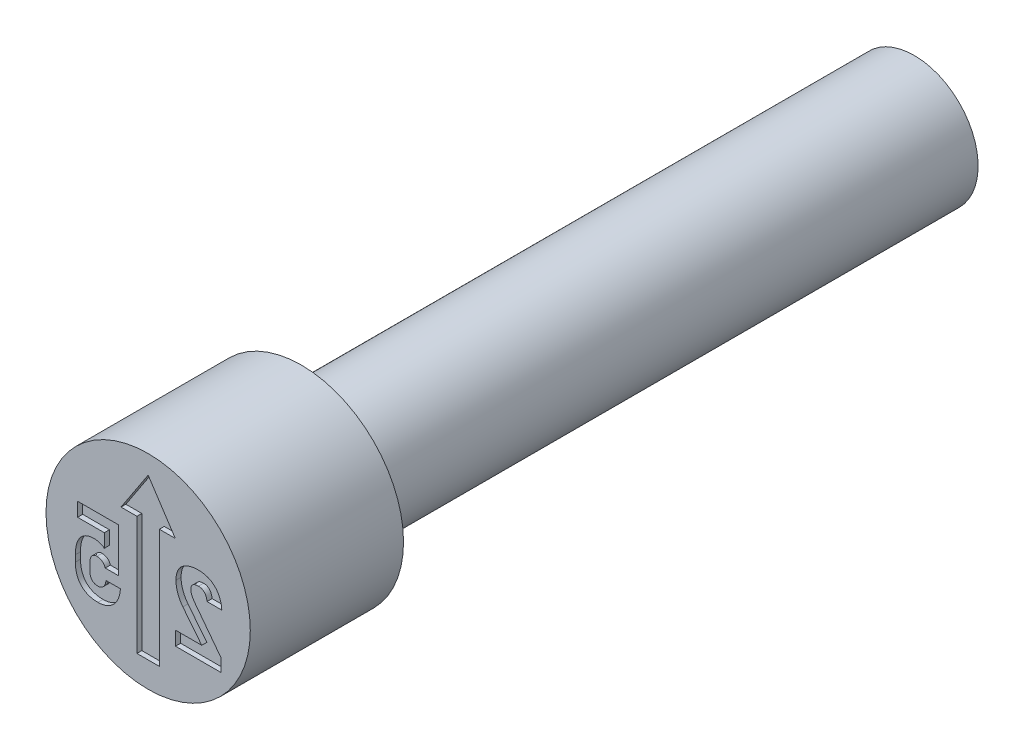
ISO-10303-21;
HEADER;
FILE_DESCRIPTION(('STEP AP214'),'2;1');
FILE_NAME('part.step','',(''),(''),'','','');
FILE_SCHEMA(('AUTOMOTIVE_DESIGN { 1 0 10303 214 1 1 1 1 }'));
ENDSEC;
DATA;
#1=APPLICATION_CONTEXT('core data for automotive mechanical design processes');
#2=APPLICATION_PROTOCOL_DEFINITION('international standard','automotive_design',2000,#1);
#3=PRODUCT_CONTEXT('',#1,'mechanical');
#4=PRODUCT('Part','Part','',(#3));
#5=PRODUCT_RELATED_PRODUCT_CATEGORY('part','',(#4));
#6=PRODUCT_DEFINITION_FORMATION('','',#4);
#7=PRODUCT_DEFINITION_CONTEXT('part definition',#1,'design');
#8=PRODUCT_DEFINITION('design','',#6,#7);
#9=PRODUCT_DEFINITION_SHAPE('','',#8);
#10=(LENGTH_UNIT() NAMED_UNIT(*) SI_UNIT(.MILLI.,.METRE.));
#11=(NAMED_UNIT(*) PLANE_ANGLE_UNIT() SI_UNIT($,.RADIAN.));
#12=(NAMED_UNIT(*) SI_UNIT($,.STERADIAN.) SOLID_ANGLE_UNIT());
#13=UNCERTAINTY_MEASURE_WITH_UNIT(LENGTH_MEASURE(1.E-05),#10,'distance_accuracy_value','');
#14=(GEOMETRIC_REPRESENTATION_CONTEXT(3) GLOBAL_UNCERTAINTY_ASSIGNED_CONTEXT((#13)) GLOBAL_UNIT_ASSIGNED_CONTEXT((#10,
#11,#12)) REPRESENTATION_CONTEXT('',''));
#15=CARTESIAN_POINT('',(0.,0.,0.));
#16=DIRECTION('',(0.,0.,1.));
#17=DIRECTION('',(1.,0.,0.));
#18=AXIS2_PLACEMENT_3D('',#15,#16,#17);
#19=CARTESIAN_POINT('',(-0.22,-1.5,-2.72238250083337));
#20=DIRECTION('',(-1.,0.,0.));
#21=DIRECTION('',(0.,0.,1.));
#22=AXIS2_PLACEMENT_3D('',#19,#20,#21);
#23=PLANE('',#22);
#24=DIRECTION('',(0.,-1.,0.));
#25=VECTOR('',#24,1.);
#26=CARTESIAN_POINT('',(-0.22,0.825524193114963,-0.0955992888));
#27=LINE('',#26,#25);
#28=CARTESIAN_POINT('',(-0.22,0.825524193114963,-0.0955992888));
#29=VERTEX_POINT('',#28);
#30=CARTESIAN_POINT('',(-0.22,-1.5,-0.0955992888));
#31=VERTEX_POINT('',#30);
#32=EDGE_CURVE('E532',#29,#31,#27,.T.);
#33=ORIENTED_EDGE('',*,*,#32,.F.);
#34=DIRECTION('',(0.,0.,1.));
#35=VECTOR('',#34,1.);
#36=CARTESIAN_POINT('',(-0.22,0.825524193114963,-0.1777996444));
#37=LINE('',#36,#35);
#38=CARTESIAN_POINT('',(-0.22,0.825524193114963,0.));
#39=VERTEX_POINT('',#38);
#40=EDGE_CURVE('E541',#39,#29,#37,.F.);
#41=ORIENTED_EDGE('',*,*,#40,.F.);
#42=DIRECTION('',(0.,1.,0.));
#43=VECTOR('',#42,1.);
#44=CARTESIAN_POINT('',(-0.22,0.,0.));
#45=LINE('',#44,#43);
#46=CARTESIAN_POINT('',(-0.22,-1.5,0.));
#47=VERTEX_POINT('',#46);
#48=EDGE_CURVE('E560',#47,#39,#45,.T.);
#49=ORIENTED_EDGE('',*,*,#48,.F.);
#50=DIRECTION('',(0.,0.,-1.));
#51=VECTOR('',#50,1.);
#52=CARTESIAN_POINT('',(-0.22,-1.5,-2.72238250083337));
#53=LINE('',#52,#51);
#54=EDGE_CURVE('E563',#47,#31,#53,.T.);
#55=ORIENTED_EDGE('',*,*,#54,.T.);
#56=EDGE_LOOP('',(#33,#41,#49,#55));
#57=FACE_BOUND('',#56,.T.);
#58=ADVANCED_FACE('F34',(#57),#23,.F.);
#59=CARTESIAN_POINT('',(3.41059817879E-13,0.825524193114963,-0.1777996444));
#60=DIRECTION('',(0.,1.,0.));
#61=DIRECTION('',(0.,0.,1.));
#62=AXIS2_PLACEMENT_3D('',#59,#60,#61);
#63=PLANE('',#62);
#64=ORIENTED_EDGE('',*,*,#40,.T.);
#65=DIRECTION('',(1.,0.,0.));
#66=VECTOR('',#65,1.);
#67=CARTESIAN_POINT('',(-0.532051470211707,0.825524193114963,-0.0955992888));
#68=LINE('',#67,#66);
#69=CARTESIAN_POINT('',(-0.532051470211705,0.825524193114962,-0.0955992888));
#70=VERTEX_POINT('',#69);
#71=EDGE_CURVE('E529',#70,#29,#68,.T.);
#72=ORIENTED_EDGE('',*,*,#71,.F.);
#73=DIRECTION('',(0.,0.,1.));
#74=VECTOR('',#73,1.);
#75=CARTESIAN_POINT('',(-0.532051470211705,0.825524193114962,-0.8127983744));
#76=LINE('',#75,#74);
#77=CARTESIAN_POINT('',(-0.532051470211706,0.825524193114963,0.));
#78=VERTEX_POINT('',#77);
#79=EDGE_CURVE('E575',#70,#78,#76,.T.);
#80=ORIENTED_EDGE('',*,*,#79,.T.);
#81=DIRECTION('',(1.,0.,0.));
#82=VECTOR('',#81,1.);
#83=CARTESIAN_POINT('',(0.999998,0.825524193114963,0.));
#84=LINE('',#83,#82);
#85=EDGE_CURVE('E557',#39,#78,#84,.F.);
#86=ORIENTED_EDGE('',*,*,#85,.F.);
#87=EDGE_LOOP('',(#64,#72,#80,#86));
#88=FACE_BOUND('',#87,.T.);
#89=ADVANCED_FACE('F610',(#88),#63,.T.);
#90=CARTESIAN_POINT('',(-0.902397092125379,0.263394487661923,-0.8127983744));
#91=DIRECTION('',(-0.835059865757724,0.550159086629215,0.));
#92=DIRECTION('',(-0.550159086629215,-0.835059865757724,0.));
#93=AXIS2_PLACEMENT_3D('',#90,#91,#92);
#94=PLANE('',#93);
#95=DIRECTION('',(-0.550159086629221,-0.83505986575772,0.));
#96=VECTOR('',#95,1.);
#97=CARTESIAN_POINT('',(0.,1.63309938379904,-0.0955992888));
#98=LINE('',#97,#96);
#99=CARTESIAN_POINT('',(0.,1.63309938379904,-0.0955992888));
#100=VERTEX_POINT('',#99);
#101=EDGE_CURVE('E526',#100,#70,#98,.T.);
#102=ORIENTED_EDGE('',*,*,#101,.F.);
#103=DIRECTION('',(0.,0.,1.));
#104=VECTOR('',#103,1.);
#105=CARTESIAN_POINT('',(0.,1.63309938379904,-0.8127983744));
#106=LINE('',#105,#104);
#107=CARTESIAN_POINT('',(0.,1.63309938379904,0.));
#108=VERTEX_POINT('',#107);
#109=EDGE_CURVE('E573',#100,#108,#106,.T.);
#110=ORIENTED_EDGE('',*,*,#109,.T.);
#111=DIRECTION('',(0.550159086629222,0.835059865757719,0.));
#112=VECTOR('',#111,1.);
#113=CARTESIAN_POINT('',(-0.532051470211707,0.825524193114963,0.));
#114=LINE('',#113,#112);
#115=EDGE_CURVE('E554',#78,#108,#114,.T.);
#116=ORIENTED_EDGE('',*,*,#115,.F.);
#117=ORIENTED_EDGE('',*,*,#79,.F.);
#118=EDGE_LOOP('',(#102,#110,#116,#117));
#119=FACE_BOUND('',#118,.T.);
#120=ADVANCED_FACE('F614',(#119),#94,.F.);
#121=CARTESIAN_POINT('',(0.,1.63309938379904,-0.8127983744));
#122=DIRECTION('',(0.835059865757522,0.550159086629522,0.));
#123=DIRECTION('',(-0.550159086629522,0.835059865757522,0.));
#124=AXIS2_PLACEMENT_3D('',#121,#122,#123);
#125=PLANE('',#124);
#126=DIRECTION('',(-0.550159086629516,0.835059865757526,0.));
#127=VECTOR('',#126,1.);
#128=CARTESIAN_POINT('',(0.532051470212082,0.825524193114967,-0.0955992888));
#129=LINE('',#128,#127);
#130=CARTESIAN_POINT('',(0.532051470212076,0.825524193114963,-0.0955992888));
#131=VERTEX_POINT('',#130);
#132=EDGE_CURVE('E523',#131,#100,#129,.T.);
#133=ORIENTED_EDGE('',*,*,#132,.F.);
#134=DIRECTION('',(0.,0.,1.));
#135=VECTOR('',#134,1.);
#136=CARTESIAN_POINT('',(0.532051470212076,0.825524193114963,-0.1777996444));
#137=LINE('',#136,#135);
#138=CARTESIAN_POINT('',(0.532051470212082,0.825524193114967,0.));
#139=VERTEX_POINT('',#138);
#140=EDGE_CURVE('E570',#139,#131,#137,.F.);
#141=ORIENTED_EDGE('',*,*,#140,.F.);
#142=DIRECTION('',(0.550159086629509,-0.83505986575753,0.));
#143=VECTOR('',#142,1.);
#144=CARTESIAN_POINT('',(0.,1.63309938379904,0.));
#145=LINE('',#144,#143);
#146=EDGE_CURVE('E551',#108,#139,#145,.T.);
#147=ORIENTED_EDGE('',*,*,#146,.F.);
#148=ORIENTED_EDGE('',*,*,#109,.F.);
#149=EDGE_LOOP('',(#133,#141,#147,#148));
#150=FACE_BOUND('',#149,.T.);
#151=ADVANCED_FACE('F618',(#150),#125,.F.);
#152=CARTESIAN_POINT('',(3.41059817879E-13,0.825524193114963,-0.1777996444));
#153=DIRECTION('',(0.,1.,0.));
#154=DIRECTION('',(0.,0.,1.));
#155=AXIS2_PLACEMENT_3D('',#152,#153,#154);
#156=PLANE('',#155);
#157=ORIENTED_EDGE('',*,*,#140,.T.);
#158=DIRECTION('',(1.,0.,0.));
#159=VECTOR('',#158,1.);
#160=CARTESIAN_POINT('',(0.22,0.825524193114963,-0.0955992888));
#161=LINE('',#160,#159);
#162=CARTESIAN_POINT('',(0.22,0.825524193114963,-0.0955992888));
#163=VERTEX_POINT('',#162);
#164=EDGE_CURVE('E489',#163,#131,#161,.T.);
#165=ORIENTED_EDGE('',*,*,#164,.F.);
#166=DIRECTION('',(0.,0.,1.));
#167=VECTOR('',#166,1.);
#168=CARTESIAN_POINT('',(0.22,0.825524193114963,-2.72238250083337));
#169=LINE('',#168,#167);
#170=CARTESIAN_POINT('',(0.22,0.825524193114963,0.));
#171=VERTEX_POINT('',#170);
#172=EDGE_CURVE('E568',#163,#171,#169,.T.);
#173=ORIENTED_EDGE('',*,*,#172,.T.);
#174=DIRECTION('',(1.,0.,0.));
#175=VECTOR('',#174,1.);
#176=CARTESIAN_POINT('',(0.999998,0.825524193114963,0.));
#177=LINE('',#176,#175);
#178=EDGE_CURVE('E548',#139,#171,#177,.F.);
#179=ORIENTED_EDGE('',*,*,#178,.F.);
#180=EDGE_LOOP('',(#157,#165,#173,#179));
#181=FACE_BOUND('',#180,.T.);
#182=ADVANCED_FACE('F620',(#181),#156,.T.);
#183=CARTESIAN_POINT('',(0.22,-1.5,-2.72238250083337));
#184=DIRECTION('',(1.,0.,0.));
#185=DIRECTION('',(0.,1.,0.));
#186=AXIS2_PLACEMENT_3D('',#183,#184,#185);
#187=PLANE('',#186);
#188=DIRECTION('',(0.,1.,0.));
#189=VECTOR('',#188,1.);
#190=CARTESIAN_POINT('',(0.22,-1.5,-0.0955992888));
#191=LINE('',#190,#189);
#192=CARTESIAN_POINT('',(0.22,-1.5,-0.0955992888));
#193=VERTEX_POINT('',#192);
#194=EDGE_CURVE('E538',#193,#163,#191,.T.);
#195=ORIENTED_EDGE('',*,*,#194,.F.);
#196=DIRECTION('',(0.,0.,-1.));
#197=VECTOR('',#196,1.);
#198=CARTESIAN_POINT('',(0.22,-1.5,-2.72238250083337));
#199=LINE('',#198,#197);
#200=CARTESIAN_POINT('',(0.22,-1.5,0.));
#201=VERTEX_POINT('',#200);
#202=EDGE_CURVE('E566',#193,#201,#199,.F.);
#203=ORIENTED_EDGE('',*,*,#202,.T.);
#204=DIRECTION('',(0.,1.,0.));
#205=VECTOR('',#204,1.);
#206=CARTESIAN_POINT('',(0.22,0.,0.));
#207=LINE('',#206,#205);
#208=EDGE_CURVE('E545',#171,#201,#207,.F.);
#209=ORIENTED_EDGE('',*,*,#208,.F.);
#210=ORIENTED_EDGE('',*,*,#172,.F.);
#211=EDGE_LOOP('',(#195,#203,#209,#210));
#212=FACE_BOUND('',#211,.T.);
#213=ADVANCED_FACE('F603',(#212),#187,.F.);
#214=CARTESIAN_POINT('',(-0.22,-1.5,-2.72238250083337));
#215=DIRECTION('',(0.,-1.,0.));
#216=DIRECTION('',(0.,0.,-1.));
#217=AXIS2_PLACEMENT_3D('',#214,#215,#216);
#218=PLANE('',#217);
#219=DIRECTION('',(1.,0.,0.));
#220=VECTOR('',#219,1.);
#221=CARTESIAN_POINT('',(-0.22,-1.5,-0.0955992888));
#222=LINE('',#221,#220);
#223=EDGE_CURVE('E535',#31,#193,#222,.T.);
#224=ORIENTED_EDGE('',*,*,#223,.F.);
#225=ORIENTED_EDGE('',*,*,#54,.F.);
#226=DIRECTION('',(1.,0.,0.));
#227=VECTOR('',#226,1.);
#228=CARTESIAN_POINT('',(0.999998,-1.5,0.));
#229=LINE('',#228,#227);
#230=EDGE_CURVE('E542',#201,#47,#229,.F.);
#231=ORIENTED_EDGE('',*,*,#230,.F.);
#232=ORIENTED_EDGE('',*,*,#202,.F.);
#233=EDGE_LOOP('',(#224,#225,#231,#232));
#234=FACE_BOUND('',#233,.T.);
#235=ADVANCED_FACE('F593',(#234),#218,.F.);
#236=CARTESIAN_POINT('',(0.999998,0.,0.));
#237=DIRECTION('',(0.,0.,1.));
#238=DIRECTION('',(1.,0.,0.));
#239=AXIS2_PLACEMENT_3D('',#236,#237,#238);
#240=PLANE('',#239);
#241=CARTESIAN_POINT('',(-1.42501555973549,-0.555227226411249,0.));
#242=CARTESIAN_POINT('',(-1.4243459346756,-0.57858927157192,0.));
#243=CARTESIAN_POINT('',(-1.42305052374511,-0.623783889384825,0.));
#244=CARTESIAN_POINT('',(-1.41378697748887,-0.689138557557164,0.));
#245=CARTESIAN_POINT('',(-1.39708742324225,-0.749087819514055,0.));
#246=CARTESIAN_POINT('',(-1.37471248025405,-0.804019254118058,0.));
#247=CARTESIAN_POINT('',(-1.34549546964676,-0.8528412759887,0.));
#248=CARTESIAN_POINT('',(-1.31050983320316,-0.895966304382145,0.));
#249=CARTESIAN_POINT('',(-1.26911711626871,-0.932398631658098,0.));
#250=CARTESIAN_POINT('',(-1.22229421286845,-0.963059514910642,0.));
#251=CARTESIAN_POINT('',(-1.16959560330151,-0.986574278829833,0.));
#252=CARTESIAN_POINT('',(-1.11186341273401,-1.00365698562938,0.));
#253=CARTESIAN_POINT('',(-1.04886917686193,-1.0138178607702,0.));
#254=CARTESIAN_POINT('',(-1.00524543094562,-1.01498596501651,0.));
#255=CARTESIAN_POINT('',(-0.982688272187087,-1.01558997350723,0.));
#256=B_SPLINE_CURVE_WITH_KNOTS('',3,(#241,#242,#243,#244,#245,#246,#247,#248,#249,#250,#251,
#252,#253,#254,#255),.UNSPECIFIED.,.F.,.F.,(4,1,1,1,1,1,1,1,1,1,1,1,4),(0.,0.0965919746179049,
0.1868602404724,0.272108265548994,0.35332451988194,0.431359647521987,0.506505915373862,
0.582010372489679,0.6584354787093,0.737063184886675,0.819709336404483,0.906774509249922,1.),.UNSPECIFIED.);
#257=CARTESIAN_POINT('',(-1.42501555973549,-0.555227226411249,0.));
#258=VERTEX_POINT('',#257);
#259=CARTESIAN_POINT('',(-0.982688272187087,-1.01558997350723,0.));
#260=VERTEX_POINT('',#259);
#261=EDGE_CURVE('E50',#258,#260,#256,.T.);
#262=ORIENTED_EDGE('',*,*,#261,.F.);
#263=DIRECTION('',(0.,-1.,0.));
#264=VECTOR('',#263,1.);
#265=CARTESIAN_POINT('',(-1.42501555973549,-0.429590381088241,0.));
#266=LINE('',#265,#264);
#267=CARTESIAN_POINT('',(-1.42501555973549,-0.429590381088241,0.));
#268=VERTEX_POINT('',#267);
#269=EDGE_CURVE('E331',#268,#258,#266,.T.);
#270=ORIENTED_EDGE('',*,*,#269,.F.);
#271=CARTESIAN_POINT('',(-1.05574716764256,0.0295496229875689,0.));
#272=CARTESIAN_POINT('',(-1.07454640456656,0.02895443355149,0.));
#273=CARTESIAN_POINT('',(-1.11100718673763,0.0278000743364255,0.));
#274=CARTESIAN_POINT('',(-1.163598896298,0.0174163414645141,0.));
#275=CARTESIAN_POINT('',(-1.21206704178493,0.000780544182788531,0.));
#276=CARTESIAN_POINT('',(-1.25601168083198,-0.0231868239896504,0.));
#277=CARTESIAN_POINT('',(-1.29548252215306,-0.053226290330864,0.));
#278=CARTESIAN_POINT('',(-1.32976592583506,-0.0899320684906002,0.));
#279=CARTESIAN_POINT('',(-1.35907561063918,-0.132705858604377,0.));
#280=CARTESIAN_POINT('',(-1.38306307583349,-0.181576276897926,0.));
#281=CARTESIAN_POINT('',(-1.40194222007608,-0.236115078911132,0.));
#282=CARTESIAN_POINT('',(-1.41565470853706,-0.295941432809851,0.));
#283=CARTESIAN_POINT('',(-1.42346914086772,-0.361113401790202,0.));
#284=CARTESIAN_POINT('',(-1.42448812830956,-0.40623518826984,0.));
#285=CARTESIAN_POINT('',(-1.42501555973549,-0.429590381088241,0.));
#286=B_SPLINE_CURVE_WITH_KNOTS('',3,(#271,#272,#273,#274,#275,#276,#277,#278,#279,#280,#281,
#282,#283,#284,#285),.UNSPECIFIED.,.F.,.F.,(4,1,1,1,1,1,1,1,1,1,1,1,4),(0.,0.0843949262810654,
0.163682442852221,0.239848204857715,0.3138063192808,0.3876154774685,0.461788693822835,
0.538496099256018,0.61978489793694,0.70565234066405,0.797279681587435,0.895071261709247,1.),.UNSPECIFIED.);
#287=CARTESIAN_POINT('',(-1.05574716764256,0.0295496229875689,0.));
#288=VERTEX_POINT('',#287);
#289=EDGE_CURVE('E334',#288,#268,#286,.T.);
#290=ORIENTED_EDGE('',*,*,#289,.F.);
#291=CARTESIAN_POINT('',(-0.858885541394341,-0.0373955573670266,0.));
#292=CARTESIAN_POINT('',(-0.864576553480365,-0.0323563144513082,0.));
#293=CARTESIAN_POINT('',(-0.876283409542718,-0.0219901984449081,0.));
#294=CARTESIAN_POINT('',(-0.896750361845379,-0.00882812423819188,0.));
#295=CARTESIAN_POINT('',(-0.920158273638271,0.00235090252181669,0.));
#296=CARTESIAN_POINT('',(-0.954698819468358,0.0152261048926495,0.));
#297=CARTESIAN_POINT('',(-1.00013541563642,0.0266752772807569,0.));
#298=CARTESIAN_POINT('',(-1.03743568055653,0.028603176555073,0.));
#299=CARTESIAN_POINT('',(-1.05574716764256,0.0295496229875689,0.));
#300=B_SPLINE_CURVE_WITH_KNOTS('',3,(#291,#292,#293,#294,#295,#296,#297,#298,#299),
.UNSPECIFIED.,.F.,.F.,(4,1,1,1,1,1,4),(0.,0.107291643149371,0.220707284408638,0.342410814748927,
0.473179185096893,0.741372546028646,1.),.UNSPECIFIED.);
#301=CARTESIAN_POINT('',(-0.858885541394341,-0.0373955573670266,0.));
#302=VERTEX_POINT('',#301);
#303=EDGE_CURVE('E1120',#302,#288,#300,.T.);
#304=ORIENTED_EDGE('',*,*,#303,.F.);
#305=DIRECTION('',(0.,-1.,0.));
#306=VECTOR('',#305,1.);
#307=CARTESIAN_POINT('',(-0.858885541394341,0.227633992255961,0.));
#308=LINE('',#307,#306);
#309=CARTESIAN_POINT('',(-0.858885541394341,0.227633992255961,0.));
#310=VERTEX_POINT('',#309);
#311=EDGE_CURVE('E1117',#310,#302,#308,.T.);
#312=ORIENTED_EDGE('',*,*,#311,.F.);
#313=DIRECTION('',(1.,0.,0.));
#314=VECTOR('',#313,1.);
#315=CARTESIAN_POINT('',(-1.38191386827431,0.227633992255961,0.));
#316=LINE('',#315,#314);
#317=CARTESIAN_POINT('',(-1.38191386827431,0.227633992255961,0.));
#318=VERTEX_POINT('',#317);
#319=EDGE_CURVE('E1114',#318,#310,#316,.T.);
#320=ORIENTED_EDGE('',*,*,#319,.F.);
#321=DIRECTION('',(0.,-1.,0.));
#322=VECTOR('',#321,1.);
#323=CARTESIAN_POINT('',(-1.38191386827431,0.5,0.));
#324=LINE('',#323,#322);
#325=CARTESIAN_POINT('',(-1.38191386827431,0.5,0.));
#326=VERTEX_POINT('',#325);
#327=EDGE_CURVE('E1111',#326,#318,#324,.T.);
#328=ORIENTED_EDGE('',*,*,#327,.F.);
#329=DIRECTION('',(-1.,0.,0.));
#330=VECTOR('',#329,1.);
#331=CARTESIAN_POINT('',(-0.576126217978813,0.5,0.));
#332=LINE('',#331,#330);
#333=CARTESIAN_POINT('',(-0.576126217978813,0.5,0.));
#334=VERTEX_POINT('',#333);
#335=EDGE_CURVE('E1108',#334,#326,#332,.T.);
#336=ORIENTED_EDGE('',*,*,#335,.F.);
#337=DIRECTION('',(0.,1.,0.));
#338=VECTOR('',#337,1.);
#339=CARTESIAN_POINT('',(-0.576126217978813,-0.362339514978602,0.));
#340=LINE('',#339,#338);
#341=CARTESIAN_POINT('',(-0.576126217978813,-0.362339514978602,0.));
#342=VERTEX_POINT('',#341);
#343=EDGE_CURVE('E1105',#342,#334,#340,.T.);
#344=ORIENTED_EDGE('',*,*,#343,.F.);
#345=DIRECTION('',(1.,0.,0.));
#346=VECTOR('',#345,1.);
#347=CARTESIAN_POINT('',(-0.840238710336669,-0.362339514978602,0.));
#348=LINE('',#347,#346);
#349=CARTESIAN_POINT('',(-0.840238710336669,-0.362339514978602,0.));
#350=VERTEX_POINT('',#349);
#351=EDGE_CURVE('E1099',#350,#342,#348,.T.);
#352=ORIENTED_EDGE('',*,*,#351,.F.);
#353=CARTESIAN_POINT('',(-1.00316921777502,-0.244650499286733,0.));
#354=CARTESIAN_POINT('',(-0.993355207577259,-0.244949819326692,0.));
#355=CARTESIAN_POINT('',(-0.974355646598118,-0.245529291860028,0.));
#356=CARTESIAN_POINT('',(-0.94699925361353,-0.251529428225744,0.));
#357=CARTESIAN_POINT('',(-0.921856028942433,-0.261346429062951,0.));
#358=CARTESIAN_POINT('',(-0.89921139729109,-0.275226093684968,0.));
#359=CARTESIAN_POINT('',(-0.879211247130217,-0.292237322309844,0.));
#360=CARTESIAN_POINT('',(-0.862744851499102,-0.312792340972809,0.));
#361=CARTESIAN_POINT('',(-0.848941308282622,-0.336018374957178,0.));
#362=CARTESIAN_POINT('',(-0.843181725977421,-0.353438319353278,0.));
#363=CARTESIAN_POINT('',(-0.840238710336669,-0.362339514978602,0.));
#364=B_SPLINE_CURVE_WITH_KNOTS('',3,(#353,#354,#355,#356,#357,#358,#359,#360,#361,#362,#363),
.UNSPECIFIED.,.F.,.F.,(4,1,1,1,1,1,1,1,4),(0.,0.135635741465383,0.262585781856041,
0.385395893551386,0.507524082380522,0.628507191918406,0.746772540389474,0.870606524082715,1.),.UNSPECIFIED.);
#365=CARTESIAN_POINT('',(-1.00316921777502,-0.244650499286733,0.));
#366=VERTEX_POINT('',#365);
#367=EDGE_CURVE('E1091',#366,#350,#364,.T.);
#368=ORIENTED_EDGE('',*,*,#367,.F.);
#369=CARTESIAN_POINT('',(-1.142561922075,-0.429590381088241,0.));
#370=CARTESIAN_POINT('',(-1.14226002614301,-0.415593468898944,0.));
#371=CARTESIAN_POINT('',(-1.14168707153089,-0.389029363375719,0.));
#372=CARTESIAN_POINT('',(-1.13455953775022,-0.351870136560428,0.));
#373=CARTESIAN_POINT('',(-1.1234776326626,-0.319449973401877,0.));
#374=CARTESIAN_POINT('',(-1.10711120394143,-0.29253699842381,0.));
#375=CARTESIAN_POINT('',(-1.08676605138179,-0.27081404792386,0.));
#376=CARTESIAN_POINT('',(-1.06214590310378,-0.255385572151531,0.));
#377=CARTESIAN_POINT('',(-1.03374526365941,-0.246273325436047,0.));
#378=CARTESIAN_POINT('',(-1.01363113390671,-0.245205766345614,0.));
#379=CARTESIAN_POINT('',(-1.00316921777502,-0.244650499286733,0.));
#380=B_SPLINE_CURVE_WITH_KNOTS('',3,(#369,#370,#371,#372,#373,#374,#375,#376,#377,#378,#379),
.UNSPECIFIED.,.F.,.F.,(4,1,1,1,1,1,1,1,4),(0.,0.160198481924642,0.304033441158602,
0.431843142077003,0.550810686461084,0.662316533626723,0.769888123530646,0.880312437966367,1.),.UNSPECIFIED.);
#381=CARTESIAN_POINT('',(-1.142561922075,-0.429590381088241,0.));
#382=VERTEX_POINT('',#381);
#383=EDGE_CURVE('E1086',#382,#366,#380,.T.);
#384=ORIENTED_EDGE('',*,*,#383,.F.);
#385=DIRECTION('',(0.,1.,0.));
#386=VECTOR('',#385,1.);
#387=CARTESIAN_POINT('',(-1.142561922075,-0.555227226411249,0.));
#388=LINE('',#387,#386);
#389=CARTESIAN_POINT('',(-1.142561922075,-0.555227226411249,0.));
#390=VERTEX_POINT('',#389);
#391=EDGE_CURVE('E1080',#390,#382,#388,.T.);
#392=ORIENTED_EDGE('',*,*,#391,.F.);
#393=CARTESIAN_POINT('',(-0.986662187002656,-0.741084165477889,0.));
#394=CARTESIAN_POINT('',(-0.998451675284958,-0.740570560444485,0.));
#395=CARTESIAN_POINT('',(-1.02100190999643,-0.739588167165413,0.));
#396=CARTESIAN_POINT('',(-1.05260979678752,-0.730106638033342,0.));
#397=CARTESIAN_POINT('',(-1.08012565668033,-0.714926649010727,0.));
#398=CARTESIAN_POINT('',(-1.10285379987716,-0.693083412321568,0.));
#399=CARTESIAN_POINT('',(-1.12098506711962,-0.665867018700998,0.));
#400=CARTESIAN_POINT('',(-1.13381941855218,-0.633275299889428,0.));
#401=CARTESIAN_POINT('',(-1.14142032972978,-0.595825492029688,0.));
#402=CARTESIAN_POINT('',(-1.14216831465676,-0.569225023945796,0.));
#403=CARTESIAN_POINT('',(-1.142561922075,-0.555227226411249,0.));
#404=B_SPLINE_CURVE_WITH_KNOTS('',3,(#393,#394,#395,#396,#397,#398,#399,#400,#401,#402,#403),
.UNSPECIFIED.,.F.,.F.,(4,1,1,1,1,1,1,1,4),(0.,0.128261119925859,0.245330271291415,
0.356275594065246,0.467886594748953,0.585607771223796,0.710231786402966,0.847517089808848,1.),.UNSPECIFIED.);
#405=CARTESIAN_POINT('',(-0.986662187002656,-0.741084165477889,0.));
#406=VERTEX_POINT('',#405);
#407=EDGE_CURVE('E1072',#406,#390,#404,.T.);
#408=ORIENTED_EDGE('',*,*,#407,.F.);
#409=CARTESIAN_POINT('',(-0.825871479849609,-0.56653759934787,0.));
#410=CARTESIAN_POINT('',(-0.827485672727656,-0.579666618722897,0.));
#411=CARTESIAN_POINT('',(-0.830561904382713,-0.604687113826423,0.));
#412=CARTESIAN_POINT('',(-0.841654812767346,-0.639408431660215,0.));
#413=CARTESIAN_POINT('',(-0.856137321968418,-0.669928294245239,0.));
#414=CARTESIAN_POINT('',(-0.875267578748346,-0.695537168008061,0.));
#415=CARTESIAN_POINT('',(-0.897984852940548,-0.716327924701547,0.));
#416=CARTESIAN_POINT('',(-0.924904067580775,-0.730428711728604,0.));
#417=CARTESIAN_POINT('',(-0.954655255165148,-0.739838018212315,0.));
#418=CARTESIAN_POINT('',(-0.975785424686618,-0.74066069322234,0.));
#419=CARTESIAN_POINT('',(-0.986662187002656,-0.741084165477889,0.));
#420=B_SPLINE_CURVE_WITH_KNOTS('',3,(#409,#410,#411,#412,#413,#414,#415,#416,#417,#418,#419),
.UNSPECIFIED.,.F.,.F.,(4,1,1,1,1,1,1,1,4),(0.,0.150277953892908,0.28639068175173,
0.412971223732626,0.533144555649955,0.648163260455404,0.760273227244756,0.876600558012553,1.),.UNSPECIFIED.);
#421=CARTESIAN_POINT('',(-0.825871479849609,-0.56653759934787,0.));
#422=VERTEX_POINT('',#421);
#423=EDGE_CURVE('E1067',#422,#406,#420,.T.);
#424=ORIENTED_EDGE('',*,*,#423,.F.);
#425=DIRECTION('',(0.,-1.,0.));
#426=VECTOR('',#425,1.);
#427=CARTESIAN_POINT('',(-0.825871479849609,-0.565620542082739,0.));
#428=LINE('',#427,#426);
#429=CARTESIAN_POINT('',(-0.825871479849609,-0.565620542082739,0.));
#430=VERTEX_POINT('',#429);
#431=EDGE_CURVE('E1064',#430,#422,#428,.T.);
#432=ORIENTED_EDGE('',*,*,#431,.F.);
#433=DIRECTION('',(-1.,0.,0.));
#434=VECTOR('',#433,1.);
#435=CARTESIAN_POINT('',(-0.543112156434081,-0.565620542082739,0.));
#436=LINE('',#435,#434);
#437=CARTESIAN_POINT('',(-0.543112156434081,-0.565620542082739,0.));
#438=VERTEX_POINT('',#437);
#439=EDGE_CURVE('E1061',#438,#430,#436,.T.);
#440=ORIENTED_EDGE('',*,*,#439,.F.);
#441=DIRECTION('',(0.,1.,0.));
#442=VECTOR('',#441,1.);
#443=CARTESIAN_POINT('',(-0.543112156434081,-0.56653759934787,0.));
#444=LINE('',#443,#442);
#445=CARTESIAN_POINT('',(-0.543112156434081,-0.56653759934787,0.));
#446=VERTEX_POINT('',#445);
#447=EDGE_CURVE('E1055',#446,#438,#444,.T.);
#448=ORIENTED_EDGE('',*,*,#447,.F.);
#449=CARTESIAN_POINT('',(-0.982688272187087,-1.01558997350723,0.));
#450=CARTESIAN_POINT('',(-0.962973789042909,-1.01498851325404,0.));
#451=CARTESIAN_POINT('',(-0.924395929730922,-1.0138115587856,0.));
#452=CARTESIAN_POINT('',(-0.868163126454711,-1.00324575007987,0.));
#453=CARTESIAN_POINT('',(-0.814852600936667,-0.986882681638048,0.));
#454=CARTESIAN_POINT('',(-0.764860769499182,-0.963539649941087,0.));
#455=CARTESIAN_POINT('',(-0.718730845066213,-0.933883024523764,0.));
#456=CARTESIAN_POINT('',(-0.677482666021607,-0.897618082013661,0.));
#457=CARTESIAN_POINT('',(-0.640737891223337,-0.855694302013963,0.));
#458=CARTESIAN_POINT('',(-0.609233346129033,-0.807744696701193,0.));
#459=CARTESIAN_POINT('',(-0.583288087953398,-0.754282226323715,0.));
#460=CARTESIAN_POINT('',(-0.5630892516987,-0.695936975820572,0.));
#461=CARTESIAN_POINT('',(-0.549215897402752,-0.632813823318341,0.));
#462=CARTESIAN_POINT('',(-0.545182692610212,-0.589020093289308,0.));
#463=CARTESIAN_POINT('',(-0.543112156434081,-0.56653759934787,0.));
#464=B_SPLINE_CURVE_WITH_KNOTS('',3,(#449,#450,#451,#452,#453,#454,#455,#456,#457,#458,#459,
#460,#461,#462,#463),.UNSPECIFIED.,.F.,.F.,(4,1,1,1,1,1,1,1,1,1,1,1,4),(0.,0.0844304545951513,
0.165215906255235,0.244369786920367,0.322918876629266,0.400936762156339,0.478631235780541,
0.557558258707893,0.639203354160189,0.723781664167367,0.811629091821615,0.903295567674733,1.),.UNSPECIFIED.);
#465=EDGE_CURVE('E1048',#260,#446,#464,.T.);
#466=ORIENTED_EDGE('',*,*,#465,.F.);
#467=EDGE_LOOP('',(#262,#270,#290,#304,#312,#320,#328,#336,#344,#352,#368,#384,#392,#408,#424,
#432,#440,#448,#466));
#468=FACE_BOUND('',#467,.T.);
#469=DIRECTION('',(0.,1.,0.));
#470=VECTOR('',#469,1.);
#471=CARTESIAN_POINT('',(1.42337653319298,-1.,0.));
#472=LINE('',#471,#470);
#473=CARTESIAN_POINT('',(1.42337653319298,-1.,0.));
#474=VERTEX_POINT('',#473);
#475=CARTESIAN_POINT('',(1.42337653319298,-0.745058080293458,0.));
#476=VERTEX_POINT('',#475);
#477=EDGE_CURVE('E58',#474,#476,#472,.T.);
#478=ORIENTED_EDGE('',*,*,#477,.F.);
#479=DIRECTION('',(1.,0.,0.));
#480=VECTOR('',#479,1.);
#481=CARTESIAN_POINT('',(0.536276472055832,-1.,0.));
#482=LINE('',#481,#480);
#483=CARTESIAN_POINT('',(0.536276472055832,-1.,0.));
#484=VERTEX_POINT('',#483);
#485=EDGE_CURVE('E483',#484,#474,#482,.T.);
#486=ORIENTED_EDGE('',*,*,#485,.F.);
#487=DIRECTION('',(0.,-1.,0.));
#488=VECTOR('',#487,1.);
#489=CARTESIAN_POINT('',(0.536276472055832,-0.727633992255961,0.));
#490=LINE('',#489,#488);
#491=CARTESIAN_POINT('',(0.536276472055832,-0.727633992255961,0.));
#492=VERTEX_POINT('',#491);
#493=EDGE_CURVE('E480',#492,#484,#490,.T.);
#494=ORIENTED_EDGE('',*,*,#493,.F.);
#495=DIRECTION('',(-1.,0.,0.));
#496=VECTOR('',#495,1.);
#497=CARTESIAN_POINT('',(1.04891148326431,-0.727633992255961,0.));
#498=LINE('',#497,#496);
#499=CARTESIAN_POINT('',(1.04891148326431,-0.727633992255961,0.));
#500=VERTEX_POINT('',#499);
#501=EDGE_CURVE('E477',#500,#492,#498,.T.);
#502=ORIENTED_EDGE('',*,*,#501,.F.);
#503=DIRECTION('',(0.620676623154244,-0.78406666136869,0.));
#504=VECTOR('',#503,1.);
#505=CARTESIAN_POINT('',(0.679643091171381,-0.261157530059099,0.));
#506=LINE('',#505,#504);
#507=CARTESIAN_POINT('',(0.679643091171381,-0.261157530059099,0.));
#508=VERTEX_POINT('',#507);
#509=EDGE_CURVE('E471',#508,#500,#506,.T.);
#510=ORIENTED_EDGE('',*,*,#509,.F.);
#511=CARTESIAN_POINT('',(0.544529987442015,0.12339514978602,0.));
#512=CARTESIAN_POINT('',(0.544921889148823,0.10635714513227,0.));
#513=CARTESIAN_POINT('',(0.54570640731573,0.0722500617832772,0.));
#514=CARTESIAN_POINT('',(0.552703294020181,0.0212951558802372,0.));
#515=CARTESIAN_POINT('',(0.564144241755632,-0.0293653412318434,0.));
#516=CARTESIAN_POINT('',(0.579668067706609,-0.0795539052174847,0.));
#517=CARTESIAN_POINT('',(0.599053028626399,-0.128432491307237,0.));
#518=CARTESIAN_POINT('',(0.622187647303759,-0.175222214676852,0.));
#519=CARTESIAN_POINT('',(0.648600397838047,-0.219803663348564,0.));
#520=CARTESIAN_POINT('',(0.669296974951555,-0.247374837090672,0.));
#521=CARTESIAN_POINT('',(0.679643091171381,-0.261157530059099,0.));
#522=B_SPLINE_CURVE_WITH_KNOTS('',3,(#511,#512,#513,#514,#515,#516,#517,#518,#519,#520,#521),
.UNSPECIFIED.,.F.,.F.,(4,1,1,1,1,1,1,1,4),(0.,0.123148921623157,0.246522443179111,
0.371108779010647,0.498350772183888,0.625999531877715,0.750879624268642,0.875465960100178,1.),.UNSPECIFIED.);
#523=CARTESIAN_POINT('',(0.544529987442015,0.12339514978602,0.));
#524=VERTEX_POINT('',#523);
#525=EDGE_CURVE('E466',#524,#508,#522,.T.);
#526=ORIENTED_EDGE('',*,*,#525,.F.);
#527=DIRECTION('',(0.,-1.,0.));
#528=VECTOR('',#527,1.);
#529=CARTESIAN_POINT('',(0.544529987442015,0.124617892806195,0.));
#530=LINE('',#529,#528);
#531=CARTESIAN_POINT('',(0.544529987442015,0.124617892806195,0.));
#532=VERTEX_POINT('',#531);
#533=EDGE_CURVE('E460',#532,#524,#530,.T.);
#534=ORIENTED_EDGE('',*,*,#533,.F.);
#535=CARTESIAN_POINT('',(0.988080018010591,0.515589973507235,0.));
#536=CARTESIAN_POINT('',(0.965533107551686,0.515118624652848,0.));
#537=CARTESIAN_POINT('',(0.921894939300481,0.514206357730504,0.));
#538=CARTESIAN_POINT('',(0.85905890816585,0.505618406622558,0.));
#539=CARTESIAN_POINT('',(0.801280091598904,0.491327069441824,0.));
#540=CARTESIAN_POINT('',(0.748703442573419,0.471248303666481,0.));
#541=CARTESIAN_POINT('',(0.701674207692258,0.445437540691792,0.));
#542=CARTESIAN_POINT('',(0.65997473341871,0.414800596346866,0.));
#543=CARTESIAN_POINT('',(0.62478239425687,0.378148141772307,0.));
#544=CARTESIAN_POINT('',(0.595509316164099,0.336510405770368,0.));
#545=CARTESIAN_POINT('',(0.572433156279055,0.290048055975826,0.));
#546=CARTESIAN_POINT('',(0.5562729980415,0.23880116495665,0.));
#547=CARTESIAN_POINT('',(0.546376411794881,0.183181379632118,0.));
#548=CARTESIAN_POINT('',(0.54515778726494,0.144529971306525,0.));
#549=CARTESIAN_POINT('',(0.544529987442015,0.124617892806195,0.));
#550=B_SPLINE_CURVE_WITH_KNOTS('',3,(#535,#536,#537,#538,#539,#540,#541,#542,#543,#544,#545,
#546,#547,#548,#549),.UNSPECIFIED.,.F.,.F.,(4,1,1,1,1,1,1,1,1,1,1,1,4),(0.,0.100715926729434,
0.194929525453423,0.2827284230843,0.366191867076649,0.44566981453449,0.521804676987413,
0.596515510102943,0.671682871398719,0.748455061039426,0.827368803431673,0.911065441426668,1.),.UNSPECIFIED.);
#551=CARTESIAN_POINT('',(0.988080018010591,0.515589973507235,0.));
#552=VERTEX_POINT('',#551);
#553=EDGE_CURVE('E452',#552,#532,#550,.T.);
#554=ORIENTED_EDGE('',*,*,#553,.F.);
#555=CARTESIAN_POINT('',(1.44202336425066,0.0668432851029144,0.));
#556=CARTESIAN_POINT('',(1.43994698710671,0.0894254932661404,0.));
#557=CARTESIAN_POINT('',(1.43590207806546,0.133417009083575,0.));
#558=CARTESIAN_POINT('',(1.42214824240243,0.196680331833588,0.));
#559=CARTESIAN_POINT('',(1.40182983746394,0.254892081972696,0.));
#560=CARTESIAN_POINT('',(1.37587025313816,0.30821293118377,0.));
#561=CARTESIAN_POINT('',(1.34403927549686,0.355969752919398,0.));
#562=CARTESIAN_POINT('',(1.30710587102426,0.398149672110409,0.));
#563=CARTESIAN_POINT('',(1.26466097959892,0.433933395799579,0.));
#564=CARTESIAN_POINT('',(1.21743980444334,0.463668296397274,0.));
#565=CARTESIAN_POINT('',(1.16564859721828,0.486938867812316,0.));
#566=CARTESIAN_POINT('',(1.10992073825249,0.503894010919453,0.));
#567=CARTESIAN_POINT('',(1.05017229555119,0.513668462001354,0.));
#568=CARTESIAN_POINT('',(1.00910604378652,0.514939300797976,0.));
#569=CARTESIAN_POINT('',(0.988080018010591,0.515589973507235,0.));
#570=B_SPLINE_CURVE_WITH_KNOTS('',3,(#555,#556,#557,#558,#559,#560,#561,#562,#563,#564,#565,
#566,#567,#568,#569),.UNSPECIFIED.,.F.,.F.,(4,1,1,1,1,1,1,1,1,1,1,1,4),(0.,0.095329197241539,
0.185707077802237,0.271513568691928,0.35413169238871,0.434493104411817,0.512233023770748,
0.58917600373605,0.667186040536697,0.746219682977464,0.827302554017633,0.911578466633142,1.),.UNSPECIFIED.);
#571=CARTESIAN_POINT('',(1.44202336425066,0.0668432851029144,0.));
#572=VERTEX_POINT('',#571);
#573=EDGE_CURVE('E447',#572,#552,#570,.T.);
#574=ORIENTED_EDGE('',*,*,#573,.F.);
#575=DIRECTION('',(0.,1.,0.));
#576=VECTOR('',#575,1.);
#577=CARTESIAN_POINT('',(1.44202336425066,0.0656205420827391,0.));
#578=LINE('',#577,#576);
#579=CARTESIAN_POINT('',(1.44202336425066,0.0656205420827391,0.));
#580=VERTEX_POINT('',#579);
#581=EDGE_CURVE('E444',#580,#572,#578,.T.);
#582=ORIENTED_EDGE('',*,*,#581,.F.);
#583=DIRECTION('',(1.,0.,0.));
#584=VECTOR('',#583,1.);
#585=CARTESIAN_POINT('',(1.15223326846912,0.0656205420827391,0.));
#586=LINE('',#585,#584);
#587=CARTESIAN_POINT('',(1.15223326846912,0.0656205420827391,0.));
#588=VERTEX_POINT('',#587);
#589=EDGE_CURVE('E441',#588,#580,#586,.T.);
#590=ORIENTED_EDGE('',*,*,#589,.F.);
#591=DIRECTION('',(0.,-1.,0.));
#592=VECTOR('',#591,1.);
#593=CARTESIAN_POINT('',(1.15223326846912,0.0668432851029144,0.));
#594=LINE('',#593,#592);
#595=CARTESIAN_POINT('',(1.15223326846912,0.0668432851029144,0.));
#596=VERTEX_POINT('',#595);
#597=EDGE_CURVE('E435',#596,#588,#594,.T.);
#598=ORIENTED_EDGE('',*,*,#597,.F.);
#599=CARTESIAN_POINT('',(0.985940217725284,0.243223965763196,0.));
#600=CARTESIAN_POINT('',(0.997103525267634,0.242752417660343,0.));
#601=CARTESIAN_POINT('',(1.01876797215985,0.241837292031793,0.));
#602=CARTESIAN_POINT('',(1.04958580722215,0.233117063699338,0.));
#603=CARTESIAN_POINT('',(1.076962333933,0.218312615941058,0.));
#604=CARTESIAN_POINT('',(1.1006611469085,0.19785251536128,0.));
#605=CARTESIAN_POINT('',(1.12054659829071,0.172113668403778,0.));
#606=CARTESIAN_POINT('',(1.13520365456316,0.141106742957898,0.));
#607=CARTESIAN_POINT('',(1.14700722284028,0.105866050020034,0.));
#608=CARTESIAN_POINT('',(1.15043260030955,0.0802888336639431,0.));
#609=CARTESIAN_POINT('',(1.15223326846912,0.0668432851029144,0.));
#610=B_SPLINE_CURVE_WITH_KNOTS('',3,(#599,#600,#601,#602,#603,#604,#605,#606,#607,#608,#609),
.UNSPECIFIED.,.F.,.F.,(4,1,1,1,1,1,1,1,4),(0.,0.124212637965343,0.241057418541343,
0.353359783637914,0.468536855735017,0.587568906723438,0.713021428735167,0.849139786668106,1.),.UNSPECIFIED.);
#611=CARTESIAN_POINT('',(0.985940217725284,0.243223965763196,0.));
#612=VERTEX_POINT('',#611);
#613=EDGE_CURVE('E427',#612,#596,#610,.T.);
#614=ORIENTED_EDGE('',*,*,#613,.F.);
#615=CARTESIAN_POINT('',(0.835542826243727,0.116364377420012,0.));
#616=CARTESIAN_POINT('',(0.835953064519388,0.125996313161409,0.));
#617=CARTESIAN_POINT('',(0.836734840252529,0.144351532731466,0.));
#618=CARTESIAN_POINT('',(0.844282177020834,0.170175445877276,0.));
#619=CARTESIAN_POINT('',(0.85676248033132,0.192506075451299,0.));
#620=CARTESIAN_POINT('',(0.87424400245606,0.211225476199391,0.));
#621=CARTESIAN_POINT('',(0.896480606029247,0.225612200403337,0.));
#622=CARTESIAN_POINT('',(0.922710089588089,0.236121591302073,0.));
#623=CARTESIAN_POINT('',(0.953071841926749,0.242067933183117,0.));
#624=CARTESIAN_POINT('',(0.974603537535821,0.242825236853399,0.));
#625=CARTESIAN_POINT('',(0.985940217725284,0.243223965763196,0.));
#626=B_SPLINE_CURVE_WITH_KNOTS('',3,(#615,#616,#617,#618,#619,#620,#621,#622,#623,#624,#625),
.UNSPECIFIED.,.F.,.F.,(4,1,1,1,1,1,1,1,4),(0.,0.129170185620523,0.246154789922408,
0.35773418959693,0.470108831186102,0.586692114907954,0.710769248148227,0.847716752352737,1.),.UNSPECIFIED.);
#627=CARTESIAN_POINT('',(0.835542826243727,0.116364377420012,0.));
#628=VERTEX_POINT('',#627);
#629=EDGE_CURVE('E422',#628,#612,#626,.T.);
#630=ORIENTED_EDGE('',*,*,#629,.F.);
#631=DIRECTION('',(0.,1.,0.));
#632=VECTOR('',#631,1.);
#633=CARTESIAN_POINT('',(0.835542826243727,0.114224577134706,0.));
#634=LINE('',#633,#632);
#635=CARTESIAN_POINT('',(0.835542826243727,0.114224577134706,0.));
#636=VERTEX_POINT('',#635);
#637=EDGE_CURVE('E416',#636,#628,#634,.T.);
#638=ORIENTED_EDGE('',*,*,#637,.F.);
#639=CARTESIAN_POINT('',(0.908601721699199,-0.0682698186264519,0.));
#640=CARTESIAN_POINT('',(0.897805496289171,-0.053291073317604,0.));
#641=CARTESIAN_POINT('',(0.876729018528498,-0.0240494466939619,0.));
#642=CARTESIAN_POINT('',(0.85787208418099,0.0162829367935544,0.));
#643=CARTESIAN_POINT('',(0.845892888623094,0.0479077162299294,0.));
#644=CARTESIAN_POINT('',(0.840354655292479,0.0708478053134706,0.));
#645=CARTESIAN_POINT('',(0.836254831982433,0.0927837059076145,0.));
#646=CARTESIAN_POINT('',(0.835776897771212,0.107175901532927,0.));
#647=CARTESIAN_POINT('',(0.835542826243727,0.114224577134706,0.));
#648=B_SPLINE_CURVE_WITH_KNOTS('',3,(#639,#640,#641,#642,#643,#644,#645,#646,#647),
.UNSPECIFIED.,.F.,.F.,(4,1,1,1,1,1,4),(0.,0.276737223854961,0.540248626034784,0.66563356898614,
0.784034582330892,0.894229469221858,1.),.UNSPECIFIED.);
#649=CARTESIAN_POINT('',(0.908601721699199,-0.0682698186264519,0.));
#650=VERTEX_POINT('',#649);
#651=EDGE_CURVE('E411',#650,#636,#648,.T.);
#652=ORIENTED_EDGE('',*,*,#651,.F.);
#653=DIRECTION('',(-0.60539313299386,0.795926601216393,0.));
#654=VECTOR('',#653,1.);
#655=CARTESIAN_POINT('',(1.42337653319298,-0.745058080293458,0.));
#656=LINE('',#655,#654);
#657=EDGE_CURVE('E407',#476,#650,#656,.T.);
#658=ORIENTED_EDGE('',*,*,#657,.F.);
#659=EDGE_LOOP('',(#478,#486,#494,#502,#510,#526,#534,#554,#574,#582,#590,#598,#614,#630,#638,
#652,#658));
#660=FACE_BOUND('',#659,.T.);
#661=CARTESIAN_POINT('',(0.,0.,0.));
#662=DIRECTION('',(0.,0.,-1.));
#663=DIRECTION('',(-1.,0.,0.));
#664=AXIS2_PLACEMENT_3D('',#661,#662,#663);
#665=CIRCLE('',#664,1.999996);
#666=CARTESIAN_POINT('',(-1.999996,0.,0.));
#667=VERTEX_POINT('',#666);
#668=EDGE_CURVE('E37',#667,#667,#665,.T.);
#669=ORIENTED_EDGE('',*,*,#668,.F.);
#670=EDGE_LOOP('',(#669));
#671=FACE_BOUND('',#670,.T.);
#672=ORIENTED_EDGE('',*,*,#208,.T.);
#673=ORIENTED_EDGE('',*,*,#230,.T.);
#674=ORIENTED_EDGE('',*,*,#48,.T.);
#675=ORIENTED_EDGE('',*,*,#85,.T.);
#676=ORIENTED_EDGE('',*,*,#115,.T.);
#677=ORIENTED_EDGE('',*,*,#146,.T.);
#678=ORIENTED_EDGE('',*,*,#178,.T.);
#679=EDGE_LOOP('',(#672,#673,#674,#675,#676,#677,#678));
#680=FACE_BOUND('',#679,.T.);
#681=ADVANCED_FACE('F590',(#468,#660,#671,#680),#240,.T.);
#682=CARTESIAN_POINT('',(0.,0.,-1.499997));
#683=DIRECTION('',(0.,0.,-1.));
#684=DIRECTION('',(-1.,0.,0.));
#685=AXIS2_PLACEMENT_3D('',#682,#683,#684);
#686=CYLINDRICAL_SURFACE('',#685,1.999996);
#687=ORIENTED_EDGE('',*,*,#668,.T.);
#688=EDGE_LOOP('',(#687));
#689=FACE_BOUND('',#688,.T.);
#690=CARTESIAN_POINT('',(0.,0.,-2.999994));
#691=DIRECTION('',(0.,0.,-1.));
#692=DIRECTION('',(-1.,0.,0.));
#693=AXIS2_PLACEMENT_3D('',#690,#691,#692);
#694=CIRCLE('',#693,1.999996);
#695=CARTESIAN_POINT('',(-1.999996,0.,-2.999994));
#696=VERTEX_POINT('',#695);
#697=EDGE_CURVE('E580',#696,#696,#694,.T.);
#698=ORIENTED_EDGE('',*,*,#697,.F.);
#699=EDGE_LOOP('',(#698));
#700=FACE_BOUND('',#699,.T.);
#701=ADVANCED_FACE('F587',(#689,#700),#686,.T.);
#702=CARTESIAN_POINT('',(0.624998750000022,0.,-14.99997));
#703=DIRECTION('',(0.,0.,-1.));
#704=DIRECTION('',(-1.,0.,0.));
#705=AXIS2_PLACEMENT_3D('',#702,#703,#704);
#706=PLANE('',#705);
#707=CARTESIAN_POINT('',(0.,0.,-14.99997));
#708=DIRECTION('',(0.,0.,-1.));
#709=DIRECTION('',(-1.,0.,0.));
#710=AXIS2_PLACEMENT_3D('',#707,#708,#709);
#711=CIRCLE('',#710,1.2499975);
#712=CARTESIAN_POINT('',(-1.24999749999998,0.,-14.99997));
#713=VERTEX_POINT('',#712);
#714=EDGE_CURVE('E42',#713,#713,#711,.F.);
#715=ORIENTED_EDGE('',*,*,#714,.F.);
#716=EDGE_LOOP('',(#715));
#717=FACE_BOUND('',#716,.T.);
#718=ADVANCED_FACE('F1191',(#717),#706,.T.);
#719=CARTESIAN_POINT('',(1.62499675,0.,-2.999994));
#720=DIRECTION('',(0.,0.,-1.));
#721=DIRECTION('',(-1.,0.,0.));
#722=AXIS2_PLACEMENT_3D('',#719,#720,#721);
#723=PLANE('',#722);
#724=CARTESIAN_POINT('',(0.,0.,-2.999994));
#725=DIRECTION('',(0.,0.,-1.));
#726=DIRECTION('',(-1.,0.,0.));
#727=AXIS2_PLACEMENT_3D('',#724,#725,#726);
#728=CIRCLE('',#727,1.2499975);
#729=CARTESIAN_POINT('',(-1.24999749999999,0.,-2.999994));
#730=VERTEX_POINT('',#729);
#731=EDGE_CURVE('E11',#730,#730,#728,.T.);
#732=ORIENTED_EDGE('',*,*,#731,.F.);
#733=EDGE_LOOP('',(#732));
#734=FACE_BOUND('',#733,.T.);
#735=ORIENTED_EDGE('',*,*,#697,.T.);
#736=EDGE_LOOP('',(#735));
#737=FACE_BOUND('',#736,.T.);
#738=ADVANCED_FACE('F1187',(#734,#737),#723,.T.);
#739=CARTESIAN_POINT('',(0.,0.,-8.999982));
#740=DIRECTION('',(0.,0.,-1.));
#741=DIRECTION('',(-1.,0.,0.));
#742=AXIS2_PLACEMENT_3D('',#739,#740,#741);
#743=CYLINDRICAL_SURFACE('',#742,1.2499975);
#744=ORIENTED_EDGE('',*,*,#714,.T.);
#745=EDGE_LOOP('',(#744));
#746=FACE_BOUND('',#745,.T.);
#747=ORIENTED_EDGE('',*,*,#731,.T.);
#748=EDGE_LOOP('',(#747));
#749=FACE_BOUND('',#748,.T.);
#750=ADVANCED_FACE('F663',(#746,#749),#743,.T.);
#751=CARTESIAN_POINT('',(0.,0.,-0.0955992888));
#752=DIRECTION('',(0.,0.,-1.));
#753=DIRECTION('',(-1.,0.,0.));
#754=AXIS2_PLACEMENT_3D('',#751,#752,#753);
#755=PLANE('',#754);
#756=ORIENTED_EDGE('',*,*,#164,.T.);
#757=ORIENTED_EDGE('',*,*,#132,.T.);
#758=ORIENTED_EDGE('',*,*,#101,.T.);
#759=ORIENTED_EDGE('',*,*,#71,.T.);
#760=ORIENTED_EDGE('',*,*,#32,.T.);
#761=ORIENTED_EDGE('',*,*,#223,.T.);
#762=ORIENTED_EDGE('',*,*,#194,.T.);
#763=EDGE_LOOP('',(#756,#757,#758,#759,#760,#761,#762));
#764=FACE_BOUND('',#763,.T.);
#765=ADVANCED_FACE('F596',(#764),#755,.F.);
#766=CARTESIAN_POINT('',(1.42337653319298,-1.,-0.1));
#767=DIRECTION('',(1.,0.,0.));
#768=DIRECTION('',(0.,0.,-1.));
#769=AXIS2_PLACEMENT_3D('',#766,#767,#768);
#770=PLANE('',#769);
#771=ORIENTED_EDGE('',*,*,#477,.T.);
#772=DIRECTION('',(0.,0.,1.));
#773=VECTOR('',#772,1.);
#774=CARTESIAN_POINT('',(1.42337653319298,-0.745058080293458,-0.1));
#775=LINE('',#774,#773);
#776=CARTESIAN_POINT('',(1.42337653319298,-0.745058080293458,-0.1));
#777=VERTEX_POINT('',#776);
#778=EDGE_CURVE('E405',#777,#476,#775,.T.);
#779=ORIENTED_EDGE('',*,*,#778,.F.);
#780=DIRECTION('',(0.,1.,0.));
#781=VECTOR('',#780,1.);
#782=CARTESIAN_POINT('',(1.42337653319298,-1.,-0.1));
#783=LINE('',#782,#781);
#784=CARTESIAN_POINT('',(1.42337653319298,-1.,-0.1));
#785=VERTEX_POINT('',#784);
#786=EDGE_CURVE('E486',#785,#777,#783,.T.);
#787=ORIENTED_EDGE('',*,*,#786,.F.);
#788=DIRECTION('',(0.,0.,1.));
#789=VECTOR('',#788,1.);
#790=CARTESIAN_POINT('',(1.42337653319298,-1.,-0.1));
#791=LINE('',#790,#789);
#792=EDGE_CURVE('E487',#785,#474,#791,.T.);
#793=ORIENTED_EDGE('',*,*,#792,.T.);
#794=EDGE_LOOP('',(#771,#779,#787,#793));
#795=FACE_BOUND('',#794,.T.);
#796=ADVANCED_FACE('F361',(#795),#770,.F.);
#797=CARTESIAN_POINT('',(0.536276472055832,-1.,-0.1));
#798=DIRECTION('',(0.,-1.,0.));
#799=DIRECTION('',(0.,0.,-1.));
#800=AXIS2_PLACEMENT_3D('',#797,#798,#799);
#801=PLANE('',#800);
#802=ORIENTED_EDGE('',*,*,#485,.T.);
#803=ORIENTED_EDGE('',*,*,#792,.F.);
#804=DIRECTION('',(1.,0.,0.));
#805=VECTOR('',#804,1.);
#806=CARTESIAN_POINT('',(0.536276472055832,-1.,-0.1));
#807=LINE('',#806,#805);
#808=CARTESIAN_POINT('',(0.536276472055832,-1.,-0.1));
#809=VERTEX_POINT('',#808);
#810=EDGE_CURVE('E402',#809,#785,#807,.T.);
#811=ORIENTED_EDGE('',*,*,#810,.F.);
#812=DIRECTION('',(0.,0.,1.));
#813=VECTOR('',#812,1.);
#814=CARTESIAN_POINT('',(0.536276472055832,-1.,-0.1));
#815=LINE('',#814,#813);
#816=EDGE_CURVE('E490',#809,#484,#815,.T.);
#817=ORIENTED_EDGE('',*,*,#816,.T.);
#818=EDGE_LOOP('',(#802,#803,#811,#817));
#819=FACE_BOUND('',#818,.T.);
#820=ADVANCED_FACE('F357',(#819),#801,.F.);
#821=CARTESIAN_POINT('',(0.536276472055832,-0.727633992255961,-0.1));
#822=DIRECTION('',(-1.,0.,0.));
#823=DIRECTION('',(0.,0.,1.));
#824=AXIS2_PLACEMENT_3D('',#821,#822,#823);
#825=PLANE('',#824);
#826=ORIENTED_EDGE('',*,*,#493,.T.);
#827=ORIENTED_EDGE('',*,*,#816,.F.);
#828=DIRECTION('',(0.,-1.,0.));
#829=VECTOR('',#828,1.);
#830=CARTESIAN_POINT('',(0.536276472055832,-0.727633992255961,-0.1));
#831=LINE('',#830,#829);
#832=CARTESIAN_POINT('',(0.536276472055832,-0.727633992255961,-0.1));
#833=VERTEX_POINT('',#832);
#834=EDGE_CURVE('E399',#833,#809,#831,.T.);
#835=ORIENTED_EDGE('',*,*,#834,.F.);
#836=DIRECTION('',(0.,0.,1.));
#837=VECTOR('',#836,1.);
#838=CARTESIAN_POINT('',(0.536276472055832,-0.727633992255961,-0.1));
#839=LINE('',#838,#837);
#840=EDGE_CURVE('E492',#833,#492,#839,.T.);
#841=ORIENTED_EDGE('',*,*,#840,.T.);
#842=EDGE_LOOP('',(#826,#827,#835,#841));
#843=FACE_BOUND('',#842,.T.);
#844=ADVANCED_FACE('F360',(#843),#825,.F.);
#845=CARTESIAN_POINT('',(1.04891148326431,-0.727633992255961,-0.1));
#846=DIRECTION('',(0.,1.,0.));
#847=DIRECTION('',(0.,0.,1.));
#848=AXIS2_PLACEMENT_3D('',#845,#846,#847);
#849=PLANE('',#848);
#850=ORIENTED_EDGE('',*,*,#501,.T.);
#851=ORIENTED_EDGE('',*,*,#840,.F.);
#852=DIRECTION('',(-1.,0.,0.));
#853=VECTOR('',#852,1.);
#854=CARTESIAN_POINT('',(1.04891148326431,-0.727633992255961,-0.1));
#855=LINE('',#854,#853);
#856=CARTESIAN_POINT('',(1.04891148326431,-0.727633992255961,-0.1));
#857=VERTEX_POINT('',#856);
#858=EDGE_CURVE('E396',#857,#833,#855,.T.);
#859=ORIENTED_EDGE('',*,*,#858,.F.);
#860=DIRECTION('',(0.,0.,1.));
#861=VECTOR('',#860,1.);
#862=CARTESIAN_POINT('',(1.04891148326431,-0.727633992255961,-0.1));
#863=LINE('',#862,#861);
#864=EDGE_CURVE('E494',#857,#500,#863,.T.);
#865=ORIENTED_EDGE('',*,*,#864,.T.);
#866=EDGE_LOOP('',(#850,#851,#859,#865));
#867=FACE_BOUND('',#866,.T.);
#868=ADVANCED_FACE('F365',(#867),#849,.F.);
#869=CARTESIAN_POINT('',(0.679643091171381,-0.261157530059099,-0.1));
#870=DIRECTION('',(-0.78406666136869,-0.620676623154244,0.));
#871=DIRECTION('',(0.620676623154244,-0.78406666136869,0.));
#872=AXIS2_PLACEMENT_3D('',#869,#870,#871);
#873=PLANE('',#872);
#874=ORIENTED_EDGE('',*,*,#509,.T.);
#875=ORIENTED_EDGE('',*,*,#864,.F.);
#876=DIRECTION('',(0.620676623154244,-0.78406666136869,0.));
#877=VECTOR('',#876,1.);
#878=CARTESIAN_POINT('',(0.679643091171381,-0.261157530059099,-0.1));
#879=LINE('',#878,#877);
#880=CARTESIAN_POINT('',(0.679643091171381,-0.261157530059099,-0.1));
#881=VERTEX_POINT('',#880);
#882=EDGE_CURVE('E388',#881,#857,#879,.T.);
#883=ORIENTED_EDGE('',*,*,#882,.F.);
#884=DIRECTION('',(0.,0.,1.));
#885=VECTOR('',#884,1.);
#886=CARTESIAN_POINT('',(0.679643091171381,-0.261157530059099,-0.1));
#887=LINE('',#886,#885);
#888=EDGE_CURVE('E496',#881,#508,#887,.T.);
#889=ORIENTED_EDGE('',*,*,#888,.T.);
#890=EDGE_LOOP('',(#874,#875,#883,#889));
#891=FACE_BOUND('',#890,.T.);
#892=ADVANCED_FACE('F369',(#891),#873,.F.);
#893=CARTESIAN_POINT('',(0.544529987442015,0.12339514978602,-0.1));
#894=CARTESIAN_POINT('',(0.544921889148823,0.10635714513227,-0.1));
#895=CARTESIAN_POINT('',(0.54570640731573,0.0722500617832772,-0.1));
#896=CARTESIAN_POINT('',(0.552703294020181,0.0212951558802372,-0.1));
#897=CARTESIAN_POINT('',(0.564144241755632,-0.0293653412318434,-0.1));
#898=CARTESIAN_POINT('',(0.579668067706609,-0.0795539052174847,-0.1));
#899=CARTESIAN_POINT('',(0.599053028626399,-0.128432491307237,-0.1));
#900=CARTESIAN_POINT('',(0.622187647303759,-0.175222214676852,-0.1));
#901=CARTESIAN_POINT('',(0.648600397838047,-0.219803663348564,-0.1));
#902=CARTESIAN_POINT('',(0.669296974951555,-0.247374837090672,-0.1));
#903=CARTESIAN_POINT('',(0.679643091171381,-0.261157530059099,-0.1));
#904=B_SPLINE_CURVE_WITH_KNOTS('',3,(#893,#894,#895,#896,#897,#898,#899,#900,#901,#902,#903),
.UNSPECIFIED.,.F.,.F.,(4,1,1,1,1,1,1,1,4),(0.,0.123148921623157,0.246522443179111,
0.371108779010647,0.498350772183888,0.625999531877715,0.750879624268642,0.875465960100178,1.),.UNSPECIFIED.);
#905=DIRECTION('',(0.,0.,1.));
#906=VECTOR('',#905,1.);
#907=SURFACE_OF_LINEAR_EXTRUSION('',#904,#906);
#908=ORIENTED_EDGE('',*,*,#525,.T.);
#909=ORIENTED_EDGE('',*,*,#888,.F.);
#910=CARTESIAN_POINT('',(0.544529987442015,0.12339514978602,-0.1));
#911=VERTEX_POINT('',#910);
#912=EDGE_CURVE('E381',#911,#881,#904,.T.);
#913=ORIENTED_EDGE('',*,*,#912,.F.);
#914=DIRECTION('',(0.,0.,1.));
#915=VECTOR('',#914,1.);
#916=CARTESIAN_POINT('',(0.544529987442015,0.12339514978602,-0.1));
#917=LINE('',#916,#915);
#918=EDGE_CURVE('E498',#911,#524,#917,.T.);
#919=ORIENTED_EDGE('',*,*,#918,.T.);
#920=EDGE_LOOP('',(#908,#909,#913,#919));
#921=FACE_BOUND('',#920,.T.);
#922=ADVANCED_FACE('F373',(#921),#907,.F.);
#923=CARTESIAN_POINT('',(0.544529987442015,0.124617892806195,-0.1));
#924=DIRECTION('',(-1.,0.,0.));
#925=DIRECTION('',(0.,0.,1.));
#926=AXIS2_PLACEMENT_3D('',#923,#924,#925);
#927=PLANE('',#926);
#928=ORIENTED_EDGE('',*,*,#533,.T.);
#929=ORIENTED_EDGE('',*,*,#918,.F.);
#930=DIRECTION('',(0.,-1.,0.));
#931=VECTOR('',#930,1.);
#932=CARTESIAN_POINT('',(0.544529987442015,0.124617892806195,-0.1));
#933=LINE('',#932,#931);
#934=CARTESIAN_POINT('',(0.544529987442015,0.124617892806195,-0.1));
#935=VERTEX_POINT('',#934);
#936=EDGE_CURVE('E389',#935,#911,#933,.T.);
#937=ORIENTED_EDGE('',*,*,#936,.F.);
#938=DIRECTION('',(0.,0.,1.));
#939=VECTOR('',#938,1.);
#940=CARTESIAN_POINT('',(0.544529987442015,0.124617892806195,-0.1));
#941=LINE('',#940,#939);
#942=EDGE_CURVE('E500',#935,#532,#941,.T.);
#943=ORIENTED_EDGE('',*,*,#942,.T.);
#944=EDGE_LOOP('',(#928,#929,#937,#943));
#945=FACE_BOUND('',#944,.T.);
#946=ADVANCED_FACE('F378',(#945),#927,.F.);
#947=CARTESIAN_POINT('',(0.988080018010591,0.515589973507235,-0.1));
#948=CARTESIAN_POINT('',(0.965533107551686,0.515118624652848,-0.1));
#949=CARTESIAN_POINT('',(0.921894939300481,0.514206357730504,-0.1));
#950=CARTESIAN_POINT('',(0.85905890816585,0.505618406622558,-0.1));
#951=CARTESIAN_POINT('',(0.801280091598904,0.491327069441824,-0.1));
#952=CARTESIAN_POINT('',(0.748703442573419,0.471248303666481,-0.1));
#953=CARTESIAN_POINT('',(0.701674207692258,0.445437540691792,-0.1));
#954=CARTESIAN_POINT('',(0.65997473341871,0.414800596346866,-0.1));
#955=CARTESIAN_POINT('',(0.62478239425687,0.378148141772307,-0.1));
#956=CARTESIAN_POINT('',(0.595509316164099,0.336510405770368,-0.1));
#957=CARTESIAN_POINT('',(0.572433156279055,0.290048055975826,-0.1));
#958=CARTESIAN_POINT('',(0.5562729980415,0.23880116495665,-0.1));
#959=CARTESIAN_POINT('',(0.546376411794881,0.183181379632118,-0.1));
#960=CARTESIAN_POINT('',(0.54515778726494,0.144529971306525,-0.1));
#961=CARTESIAN_POINT('',(0.544529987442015,0.124617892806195,-0.1));
#962=B_SPLINE_CURVE_WITH_KNOTS('',3,(#947,#948,#949,#950,#951,#952,#953,#954,#955,#956,#957,
#958,#959,#960,#961),.UNSPECIFIED.,.F.,.F.,(4,1,1,1,1,1,1,1,1,1,1,1,4),(0.,0.100715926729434,
0.194929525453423,0.2827284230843,0.366191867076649,0.44566981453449,0.521804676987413,
0.596515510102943,0.671682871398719,0.748455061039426,0.827368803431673,0.911065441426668,1.),.UNSPECIFIED.);
#963=DIRECTION('',(0.,0.,1.));
#964=VECTOR('',#963,1.);
#965=SURFACE_OF_LINEAR_EXTRUSION('',#962,#964);
#966=ORIENTED_EDGE('',*,*,#553,.T.);
#967=ORIENTED_EDGE('',*,*,#942,.F.);
#968=CARTESIAN_POINT('',(0.988080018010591,0.515589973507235,-0.1));
#969=VERTEX_POINT('',#968);
#970=EDGE_CURVE('E1263',#969,#935,#962,.T.);
#971=ORIENTED_EDGE('',*,*,#970,.F.);
#972=DIRECTION('',(0.,0.,1.));
#973=VECTOR('',#972,1.);
#974=CARTESIAN_POINT('',(0.988080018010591,0.515589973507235,-0.1));
#975=LINE('',#974,#973);
#976=EDGE_CURVE('E502',#969,#552,#975,.T.);
#977=ORIENTED_EDGE('',*,*,#976,.T.);
#978=EDGE_LOOP('',(#966,#967,#971,#977));
#979=FACE_BOUND('',#978,.T.);
#980=ADVANCED_FACE('F727',(#979),#965,.F.);
#981=CARTESIAN_POINT('',(1.44202336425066,0.0668432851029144,-0.1));
#982=CARTESIAN_POINT('',(1.43994698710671,0.0894254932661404,-0.1));
#983=CARTESIAN_POINT('',(1.43590207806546,0.133417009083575,-0.1));
#984=CARTESIAN_POINT('',(1.42214824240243,0.196680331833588,-0.1));
#985=CARTESIAN_POINT('',(1.40182983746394,0.254892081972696,-0.1));
#986=CARTESIAN_POINT('',(1.37587025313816,0.30821293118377,-0.1));
#987=CARTESIAN_POINT('',(1.34403927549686,0.355969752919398,-0.1));
#988=CARTESIAN_POINT('',(1.30710587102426,0.398149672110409,-0.1));
#989=CARTESIAN_POINT('',(1.26466097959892,0.433933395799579,-0.1));
#990=CARTESIAN_POINT('',(1.21743980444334,0.463668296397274,-0.1));
#991=CARTESIAN_POINT('',(1.16564859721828,0.486938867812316,-0.1));
#992=CARTESIAN_POINT('',(1.10992073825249,0.503894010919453,-0.1));
#993=CARTESIAN_POINT('',(1.05017229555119,0.513668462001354,-0.1));
#994=CARTESIAN_POINT('',(1.00910604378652,0.514939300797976,-0.1));
#995=CARTESIAN_POINT('',(0.988080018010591,0.515589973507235,-0.1));
#996=B_SPLINE_CURVE_WITH_KNOTS('',3,(#981,#982,#983,#984,#985,#986,#987,#988,#989,#990,#991,
#992,#993,#994,#995),.UNSPECIFIED.,.F.,.F.,(4,1,1,1,1,1,1,1,1,1,1,1,4),(0.,0.095329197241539,
0.185707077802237,0.271513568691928,0.35413169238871,0.434493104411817,0.512233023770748,
0.58917600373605,0.667186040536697,0.746219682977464,0.827302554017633,0.911578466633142,1.),.UNSPECIFIED.);
#997=DIRECTION('',(0.,0.,1.));
#998=VECTOR('',#997,1.);
#999=SURFACE_OF_LINEAR_EXTRUSION('',#996,#998);
#1000=ORIENTED_EDGE('',*,*,#573,.T.);
#1001=ORIENTED_EDGE('',*,*,#976,.F.);
#1002=CARTESIAN_POINT('',(1.44202336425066,0.0668432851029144,-0.1));
#1003=VERTEX_POINT('',#1002);
#1004=EDGE_CURVE('E1258',#1003,#969,#996,.T.);
#1005=ORIENTED_EDGE('',*,*,#1004,.F.);
#1006=DIRECTION('',(0.,0.,1.));
#1007=VECTOR('',#1006,1.);
#1008=CARTESIAN_POINT('',(1.44202336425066,0.0668432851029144,-0.1));
#1009=LINE('',#1008,#1007);
#1010=EDGE_CURVE('E504',#1003,#572,#1009,.T.);
#1011=ORIENTED_EDGE('',*,*,#1010,.T.);
#1012=EDGE_LOOP('',(#1000,#1001,#1005,#1011));
#1013=FACE_BOUND('',#1012,.T.);
#1014=ADVANCED_FACE('F736',(#1013),#999,.F.);
#1015=CARTESIAN_POINT('',(1.44202336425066,0.0656205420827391,-0.1));
#1016=DIRECTION('',(1.,0.,0.));
#1017=DIRECTION('',(0.,0.,-1.));
#1018=AXIS2_PLACEMENT_3D('',#1015,#1016,#1017);
#1019=PLANE('',#1018);
#1020=ORIENTED_EDGE('',*,*,#581,.T.);
#1021=ORIENTED_EDGE('',*,*,#1010,.F.);
#1022=DIRECTION('',(0.,1.,0.));
#1023=VECTOR('',#1022,1.);
#1024=CARTESIAN_POINT('',(1.44202336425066,0.0656205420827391,-0.1));
#1025=LINE('',#1024,#1023);
#1026=CARTESIAN_POINT('',(1.44202336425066,0.0656205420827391,-0.1));
#1027=VERTEX_POINT('',#1026);
#1028=EDGE_CURVE('E1255',#1027,#1003,#1025,.T.);
#1029=ORIENTED_EDGE('',*,*,#1028,.F.);
#1030=DIRECTION('',(0.,0.,1.));
#1031=VECTOR('',#1030,1.);
#1032=CARTESIAN_POINT('',(1.44202336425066,0.0656205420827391,-0.1));
#1033=LINE('',#1032,#1031);
#1034=EDGE_CURVE('E506',#1027,#580,#1033,.T.);
#1035=ORIENTED_EDGE('',*,*,#1034,.T.);
#1036=EDGE_LOOP('',(#1020,#1021,#1029,#1035));
#1037=FACE_BOUND('',#1036,.T.);
#1038=ADVANCED_FACE('F745',(#1037),#1019,.F.);
#1039=CARTESIAN_POINT('',(1.15223326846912,0.0656205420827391,-0.1));
#1040=DIRECTION('',(0.,-1.,0.));
#1041=DIRECTION('',(0.,0.,-1.));
#1042=AXIS2_PLACEMENT_3D('',#1039,#1040,#1041);
#1043=PLANE('',#1042);
#1044=ORIENTED_EDGE('',*,*,#589,.T.);
#1045=ORIENTED_EDGE('',*,*,#1034,.F.);
#1046=DIRECTION('',(1.,0.,0.));
#1047=VECTOR('',#1046,1.);
#1048=CARTESIAN_POINT('',(1.15223326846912,0.0656205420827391,-0.1));
#1049=LINE('',#1048,#1047);
#1050=CARTESIAN_POINT('',(1.15223326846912,0.0656205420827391,-0.1));
#1051=VERTEX_POINT('',#1050);
#1052=EDGE_CURVE('E1252',#1051,#1027,#1049,.T.);
#1053=ORIENTED_EDGE('',*,*,#1052,.F.);
#1054=DIRECTION('',(0.,0.,1.));
#1055=VECTOR('',#1054,1.);
#1056=CARTESIAN_POINT('',(1.15223326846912,0.0656205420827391,-0.1));
#1057=LINE('',#1056,#1055);
#1058=EDGE_CURVE('E508',#1051,#588,#1057,.T.);
#1059=ORIENTED_EDGE('',*,*,#1058,.T.);
#1060=EDGE_LOOP('',(#1044,#1045,#1053,#1059));
#1061=FACE_BOUND('',#1060,.T.);
#1062=ADVANCED_FACE('F755',(#1061),#1043,.F.);
#1063=CARTESIAN_POINT('',(1.15223326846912,0.0668432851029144,-0.1));
#1064=DIRECTION('',(-1.,0.,0.));
#1065=DIRECTION('',(0.,0.,1.));
#1066=AXIS2_PLACEMENT_3D('',#1063,#1064,#1065);
#1067=PLANE('',#1066);
#1068=ORIENTED_EDGE('',*,*,#597,.T.);
#1069=ORIENTED_EDGE('',*,*,#1058,.F.);
#1070=DIRECTION('',(0.,-1.,0.));
#1071=VECTOR('',#1070,1.);
#1072=CARTESIAN_POINT('',(1.15223326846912,0.0668432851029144,-0.1));
#1073=LINE('',#1072,#1071);
#1074=CARTESIAN_POINT('',(1.15223326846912,0.0668432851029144,-0.1));
#1075=VERTEX_POINT('',#1074);
#1076=EDGE_CURVE('E1246',#1075,#1051,#1073,.T.);
#1077=ORIENTED_EDGE('',*,*,#1076,.F.);
#1078=DIRECTION('',(0.,0.,1.));
#1079=VECTOR('',#1078,1.);
#1080=CARTESIAN_POINT('',(1.15223326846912,0.0668432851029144,-0.1));
#1081=LINE('',#1080,#1079);
#1082=EDGE_CURVE('E510',#1075,#596,#1081,.T.);
#1083=ORIENTED_EDGE('',*,*,#1082,.T.);
#1084=EDGE_LOOP('',(#1068,#1069,#1077,#1083));
#1085=FACE_BOUND('',#1084,.T.);
#1086=ADVANCED_FACE('F765',(#1085),#1067,.F.);
#1087=CARTESIAN_POINT('',(0.985940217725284,0.243223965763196,-0.1));
#1088=CARTESIAN_POINT('',(0.997103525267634,0.242752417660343,-0.1));
#1089=CARTESIAN_POINT('',(1.01876797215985,0.241837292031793,-0.1));
#1090=CARTESIAN_POINT('',(1.04958580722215,0.233117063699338,-0.1));
#1091=CARTESIAN_POINT('',(1.076962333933,0.218312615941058,-0.1));
#1092=CARTESIAN_POINT('',(1.1006611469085,0.19785251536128,-0.1));
#1093=CARTESIAN_POINT('',(1.12054659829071,0.172113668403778,-0.1));
#1094=CARTESIAN_POINT('',(1.13520365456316,0.141106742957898,-0.1));
#1095=CARTESIAN_POINT('',(1.14700722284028,0.105866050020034,-0.1));
#1096=CARTESIAN_POINT('',(1.15043260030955,0.0802888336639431,-0.1));
#1097=CARTESIAN_POINT('',(1.15223326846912,0.0668432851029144,-0.1));
#1098=B_SPLINE_CURVE_WITH_KNOTS('',3,(#1087,#1088,#1089,#1090,#1091,#1092,#1093,#1094,#1095,
#1096,#1097),.UNSPECIFIED.,.F.,.F.,(4,1,1,1,1,1,1,1,4),(0.,0.124212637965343,0.241057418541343,
0.353359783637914,0.468536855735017,0.587568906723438,0.713021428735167,0.849139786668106,1.),.UNSPECIFIED.);
#1099=DIRECTION('',(0.,0.,1.));
#1100=VECTOR('',#1099,1.);
#1101=SURFACE_OF_LINEAR_EXTRUSION('',#1098,#1100);
#1102=ORIENTED_EDGE('',*,*,#613,.T.);
#1103=ORIENTED_EDGE('',*,*,#1082,.F.);
#1104=CARTESIAN_POINT('',(0.985940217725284,0.243223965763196,-0.1));
#1105=VERTEX_POINT('',#1104);
#1106=EDGE_CURVE('E1237',#1105,#1075,#1098,.T.);
#1107=ORIENTED_EDGE('',*,*,#1106,.F.);
#1108=DIRECTION('',(0.,0.,1.));
#1109=VECTOR('',#1108,1.);
#1110=CARTESIAN_POINT('',(0.985940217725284,0.243223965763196,-0.1));
#1111=LINE('',#1110,#1109);
#1112=EDGE_CURVE('E512',#1105,#612,#1111,.T.);
#1113=ORIENTED_EDGE('',*,*,#1112,.T.);
#1114=EDGE_LOOP('',(#1102,#1103,#1107,#1113));
#1115=FACE_BOUND('',#1114,.T.);
#1116=ADVANCED_FACE('F775',(#1115),#1101,.F.);
#1117=CARTESIAN_POINT('',(0.835542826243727,0.116364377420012,-0.1));
#1118=CARTESIAN_POINT('',(0.835953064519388,0.125996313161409,-0.1));
#1119=CARTESIAN_POINT('',(0.836734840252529,0.144351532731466,-0.1));
#1120=CARTESIAN_POINT('',(0.844282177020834,0.170175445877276,-0.1));
#1121=CARTESIAN_POINT('',(0.85676248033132,0.192506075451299,-0.1));
#1122=CARTESIAN_POINT('',(0.87424400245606,0.211225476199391,-0.1));
#1123=CARTESIAN_POINT('',(0.896480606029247,0.225612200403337,-0.1));
#1124=CARTESIAN_POINT('',(0.922710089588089,0.236121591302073,-0.1));
#1125=CARTESIAN_POINT('',(0.953071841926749,0.242067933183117,-0.1));
#1126=CARTESIAN_POINT('',(0.974603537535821,0.242825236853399,-0.1));
#1127=CARTESIAN_POINT('',(0.985940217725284,0.243223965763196,-0.1));
#1128=B_SPLINE_CURVE_WITH_KNOTS('',3,(#1117,#1118,#1119,#1120,#1121,#1122,#1123,#1124,#1125,
#1126,#1127),.UNSPECIFIED.,.F.,.F.,(4,1,1,1,1,1,1,1,4),(0.,0.129170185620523,0.246154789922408,
0.35773418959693,0.470108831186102,0.586692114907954,0.710769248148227,0.847716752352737,1.),.UNSPECIFIED.);
#1129=DIRECTION('',(0.,0.,1.));
#1130=VECTOR('',#1129,1.);
#1131=SURFACE_OF_LINEAR_EXTRUSION('',#1128,#1130);
#1132=ORIENTED_EDGE('',*,*,#629,.T.);
#1133=ORIENTED_EDGE('',*,*,#1112,.F.);
#1134=CARTESIAN_POINT('',(0.835542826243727,0.116364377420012,-0.1));
#1135=VERTEX_POINT('',#1134);
#1136=EDGE_CURVE('E1232',#1135,#1105,#1128,.T.);
#1137=ORIENTED_EDGE('',*,*,#1136,.F.);
#1138=DIRECTION('',(0.,0.,1.));
#1139=VECTOR('',#1138,1.);
#1140=CARTESIAN_POINT('',(0.835542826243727,0.116364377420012,-0.1));
#1141=LINE('',#1140,#1139);
#1142=EDGE_CURVE('E514',#1135,#628,#1141,.T.);
#1143=ORIENTED_EDGE('',*,*,#1142,.T.);
#1144=EDGE_LOOP('',(#1132,#1133,#1137,#1143));
#1145=FACE_BOUND('',#1144,.T.);
#1146=ADVANCED_FACE('F785',(#1145),#1131,.F.);
#1147=CARTESIAN_POINT('',(0.835542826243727,0.114224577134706,-0.1));
#1148=DIRECTION('',(1.,0.,0.));
#1149=DIRECTION('',(0.,0.,-1.));
#1150=AXIS2_PLACEMENT_3D('',#1147,#1148,#1149);
#1151=PLANE('',#1150);
#1152=ORIENTED_EDGE('',*,*,#637,.T.);
#1153=ORIENTED_EDGE('',*,*,#1142,.F.);
#1154=DIRECTION('',(0.,1.,0.));
#1155=VECTOR('',#1154,1.);
#1156=CARTESIAN_POINT('',(0.835542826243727,0.114224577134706,-0.1));
#1157=LINE('',#1156,#1155);
#1158=CARTESIAN_POINT('',(0.835542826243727,0.114224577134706,-0.1));
#1159=VERTEX_POINT('',#1158);
#1160=EDGE_CURVE('E1180',#1159,#1135,#1157,.T.);
#1161=ORIENTED_EDGE('',*,*,#1160,.F.);
#1162=DIRECTION('',(0.,0.,1.));
#1163=VECTOR('',#1162,1.);
#1164=CARTESIAN_POINT('',(0.835542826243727,0.114224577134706,-0.1));
#1165=LINE('',#1164,#1163);
#1166=EDGE_CURVE('E516',#1159,#636,#1165,.T.);
#1167=ORIENTED_EDGE('',*,*,#1166,.T.);
#1168=EDGE_LOOP('',(#1152,#1153,#1161,#1167));
#1169=FACE_BOUND('',#1168,.T.);
#1170=ADVANCED_FACE('F795',(#1169),#1151,.F.);
#1171=CARTESIAN_POINT('',(0.908601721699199,-0.0682698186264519,-0.1));
#1172=CARTESIAN_POINT('',(0.897805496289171,-0.053291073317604,-0.1));
#1173=CARTESIAN_POINT('',(0.876729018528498,-0.0240494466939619,-0.1));
#1174=CARTESIAN_POINT('',(0.85787208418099,0.0162829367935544,-0.1));
#1175=CARTESIAN_POINT('',(0.845892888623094,0.0479077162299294,-0.1));
#1176=CARTESIAN_POINT('',(0.840354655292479,0.0708478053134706,-0.1));
#1177=CARTESIAN_POINT('',(0.836254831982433,0.0927837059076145,-0.1));
#1178=CARTESIAN_POINT('',(0.835776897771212,0.107175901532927,-0.1));
#1179=CARTESIAN_POINT('',(0.835542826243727,0.114224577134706,-0.1));
#1180=B_SPLINE_CURVE_WITH_KNOTS('',3,(#1171,#1172,#1173,#1174,#1175,#1176,#1177,#1178,#1179),
.UNSPECIFIED.,.F.,.F.,(4,1,1,1,1,1,4),(0.,0.276737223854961,0.540248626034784,0.66563356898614,
0.784034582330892,0.894229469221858,1.),.UNSPECIFIED.);
#1181=DIRECTION('',(0.,0.,1.));
#1182=VECTOR('',#1181,1.);
#1183=SURFACE_OF_LINEAR_EXTRUSION('',#1180,#1182);
#1184=ORIENTED_EDGE('',*,*,#651,.T.);
#1185=ORIENTED_EDGE('',*,*,#1166,.F.);
#1186=CARTESIAN_POINT('',(0.908601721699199,-0.0682698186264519,-0.1));
#1187=VERTEX_POINT('',#1186);
#1188=EDGE_CURVE('E1174',#1187,#1159,#1180,.T.);
#1189=ORIENTED_EDGE('',*,*,#1188,.F.);
#1190=DIRECTION('',(0.,0.,1.));
#1191=VECTOR('',#1190,1.);
#1192=CARTESIAN_POINT('',(0.908601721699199,-0.0682698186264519,-0.1));
#1193=LINE('',#1192,#1191);
#1194=EDGE_CURVE('E518',#1187,#650,#1193,.T.);
#1195=ORIENTED_EDGE('',*,*,#1194,.T.);
#1196=EDGE_LOOP('',(#1184,#1185,#1189,#1195));
#1197=FACE_BOUND('',#1196,.T.);
#1198=ADVANCED_FACE('F805',(#1197),#1183,.F.);
#1199=CARTESIAN_POINT('',(1.42337653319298,-0.745058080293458,-0.1));
#1200=DIRECTION('',(0.795926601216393,0.60539313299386,0.));
#1201=DIRECTION('',(-0.60539313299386,0.795926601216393,0.));
#1202=AXIS2_PLACEMENT_3D('',#1199,#1200,#1201);
#1203=PLANE('',#1202);
#1204=ORIENTED_EDGE('',*,*,#657,.T.);
#1205=ORIENTED_EDGE('',*,*,#1194,.F.);
#1206=DIRECTION('',(-0.60539313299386,0.795926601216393,0.));
#1207=VECTOR('',#1206,1.);
#1208=CARTESIAN_POINT('',(1.42337653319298,-0.745058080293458,-0.1));
#1209=LINE('',#1208,#1207);
#1210=EDGE_CURVE('E1171',#777,#1187,#1209,.T.);
#1211=ORIENTED_EDGE('',*,*,#1210,.F.);
#1212=ORIENTED_EDGE('',*,*,#778,.T.);
#1213=EDGE_LOOP('',(#1204,#1205,#1211,#1212));
#1214=FACE_BOUND('',#1213,.T.);
#1215=ADVANCED_FACE('F355',(#1214),#1203,.F.);
#1216=CARTESIAN_POINT('',(0.857896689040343,0.0175287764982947,-0.1));
#1217=DIRECTION('',(0.,0.,1.));
#1218=DIRECTION('',(1.,0.,0.));
#1219=AXIS2_PLACEMENT_3D('',#1216,#1217,#1218);
#1220=PLANE('',#1219);
#1221=ORIENTED_EDGE('',*,*,#786,.T.);
#1222=ORIENTED_EDGE('',*,*,#1210,.T.);
#1223=ORIENTED_EDGE('',*,*,#1188,.T.);
#1224=ORIENTED_EDGE('',*,*,#1160,.T.);
#1225=ORIENTED_EDGE('',*,*,#1136,.T.);
#1226=ORIENTED_EDGE('',*,*,#1106,.T.);
#1227=ORIENTED_EDGE('',*,*,#1076,.T.);
#1228=ORIENTED_EDGE('',*,*,#1052,.T.);
#1229=ORIENTED_EDGE('',*,*,#1028,.T.);
#1230=ORIENTED_EDGE('',*,*,#1004,.T.);
#1231=ORIENTED_EDGE('',*,*,#970,.T.);
#1232=ORIENTED_EDGE('',*,*,#936,.T.);
#1233=ORIENTED_EDGE('',*,*,#912,.T.);
#1234=ORIENTED_EDGE('',*,*,#882,.T.);
#1235=ORIENTED_EDGE('',*,*,#858,.T.);
#1236=ORIENTED_EDGE('',*,*,#834,.T.);
#1237=ORIENTED_EDGE('',*,*,#810,.T.);
#1238=EDGE_LOOP('',(#1221,#1222,#1223,#1224,#1225,#1226,#1227,#1228,#1229,#1230,#1231,#1232,
#1233,#1234,#1235,#1236,#1237));
#1239=FACE_BOUND('',#1238,.T.);
#1240=ADVANCED_FACE('F351',(#1239),#1220,.T.);
#1241=CARTESIAN_POINT('',(-1.42501555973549,-0.555227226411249,-0.1));
#1242=CARTESIAN_POINT('',(-1.4243459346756,-0.57858927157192,-0.1));
#1243=CARTESIAN_POINT('',(-1.42305052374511,-0.623783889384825,-0.1));
#1244=CARTESIAN_POINT('',(-1.41378697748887,-0.689138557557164,-0.1));
#1245=CARTESIAN_POINT('',(-1.39708742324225,-0.749087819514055,-0.1));
#1246=CARTESIAN_POINT('',(-1.37471248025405,-0.804019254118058,-0.1));
#1247=CARTESIAN_POINT('',(-1.34549546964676,-0.8528412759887,-0.1));
#1248=CARTESIAN_POINT('',(-1.31050983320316,-0.895966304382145,-0.1));
#1249=CARTESIAN_POINT('',(-1.26911711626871,-0.932398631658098,-0.1));
#1250=CARTESIAN_POINT('',(-1.22229421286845,-0.963059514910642,-0.1));
#1251=CARTESIAN_POINT('',(-1.16959560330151,-0.986574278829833,-0.1));
#1252=CARTESIAN_POINT('',(-1.11186341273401,-1.00365698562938,-0.1));
#1253=CARTESIAN_POINT('',(-1.04886917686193,-1.0138178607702,-0.1));
#1254=CARTESIAN_POINT('',(-1.00524543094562,-1.01498596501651,-0.1));
#1255=CARTESIAN_POINT('',(-0.982688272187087,-1.01558997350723,-0.1));
#1256=B_SPLINE_CURVE_WITH_KNOTS('',3,(#1241,#1242,#1243,#1244,#1245,#1246,#1247,#1248,#1249,
#1250,#1251,#1252,#1253,#1254,#1255),.UNSPECIFIED.,.F.,.F.,(4,1,1,1,1,1,1,1,1,1,1,1,4),(0.,
0.0965919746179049,0.1868602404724,0.272108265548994,0.35332451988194,0.431359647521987,
0.506505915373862,0.582010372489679,0.6584354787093,0.737063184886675,0.819709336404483,
0.906774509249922,1.),.UNSPECIFIED.);
#1257=DIRECTION('',(0.,0.,1.));
#1258=VECTOR('',#1257,1.);
#1259=SURFACE_OF_LINEAR_EXTRUSION('',#1256,#1258);
#1260=ORIENTED_EDGE('',*,*,#261,.T.);
#1261=DIRECTION('',(0.,0.,1.));
#1262=VECTOR('',#1261,1.);
#1263=CARTESIAN_POINT('',(-0.982688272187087,-1.01558997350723,-0.1));
#1264=LINE('',#1263,#1262);
#1265=CARTESIAN_POINT('',(-0.982688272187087,-1.01558997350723,-0.1));
#1266=VERTEX_POINT('',#1265);
#1267=EDGE_CURVE('E308',#1266,#260,#1264,.T.);
#1268=ORIENTED_EDGE('',*,*,#1267,.F.);
#1269=CARTESIAN_POINT('',(-1.42501555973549,-0.555227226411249,-0.1));
#1270=VERTEX_POINT('',#1269);
#1271=EDGE_CURVE('E312',#1270,#1266,#1256,.T.);
#1272=ORIENTED_EDGE('',*,*,#1271,.F.);
#1273=DIRECTION('',(0.,0.,1.));
#1274=VECTOR('',#1273,1.);
#1275=CARTESIAN_POINT('',(-1.42501555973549,-0.555227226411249,-0.1));
#1276=LINE('',#1275,#1274);
#1277=EDGE_CURVE('E408',#1270,#258,#1276,.T.);
#1278=ORIENTED_EDGE('',*,*,#1277,.T.);
#1279=EDGE_LOOP('',(#1260,#1268,#1272,#1278));
#1280=FACE_BOUND('',#1279,.T.);
#1281=ADVANCED_FACE('F310',(#1280),#1259,.F.);
#1282=CARTESIAN_POINT('',(-1.42501555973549,-0.429590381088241,-0.1));
#1283=DIRECTION('',(-1.,0.,0.));
#1284=DIRECTION('',(0.,0.,1.));
#1285=AXIS2_PLACEMENT_3D('',#1282,#1283,#1284);
#1286=PLANE('',#1285);
#1287=ORIENTED_EDGE('',*,*,#269,.T.);
#1288=ORIENTED_EDGE('',*,*,#1277,.F.);
#1289=DIRECTION('',(0.,-1.,0.));
#1290=VECTOR('',#1289,1.);
#1291=CARTESIAN_POINT('',(-1.42501555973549,-0.429590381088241,-0.1));
#1292=LINE('',#1291,#1290);
#1293=CARTESIAN_POINT('',(-1.42501555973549,-0.429590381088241,-0.1));
#1294=VERTEX_POINT('',#1293);
#1295=EDGE_CURVE('E318',#1294,#1270,#1292,.T.);
#1296=ORIENTED_EDGE('',*,*,#1295,.F.);
#1297=DIRECTION('',(0.,0.,1.));
#1298=VECTOR('',#1297,1.);
#1299=CARTESIAN_POINT('',(-1.42501555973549,-0.429590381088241,-0.1));
#1300=LINE('',#1299,#1298);
#1301=EDGE_CURVE('E1136',#1294,#268,#1300,.T.);
#1302=ORIENTED_EDGE('',*,*,#1301,.T.);
#1303=EDGE_LOOP('',(#1287,#1288,#1296,#1302));
#1304=FACE_BOUND('',#1303,.T.);
#1305=ADVANCED_FACE('F350',(#1304),#1286,.F.);
#1306=CARTESIAN_POINT('',(-1.05574716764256,0.0295496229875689,-0.1));
#1307=CARTESIAN_POINT('',(-1.07454640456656,0.02895443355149,-0.1));
#1308=CARTESIAN_POINT('',(-1.11100718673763,0.0278000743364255,-0.1));
#1309=CARTESIAN_POINT('',(-1.163598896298,0.0174163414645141,-0.1));
#1310=CARTESIAN_POINT('',(-1.21206704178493,0.000780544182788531,-0.1));
#1311=CARTESIAN_POINT('',(-1.25601168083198,-0.0231868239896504,-0.1));
#1312=CARTESIAN_POINT('',(-1.29548252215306,-0.053226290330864,-0.1));
#1313=CARTESIAN_POINT('',(-1.32976592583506,-0.0899320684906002,-0.1));
#1314=CARTESIAN_POINT('',(-1.35907561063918,-0.132705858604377,-0.1));
#1315=CARTESIAN_POINT('',(-1.38306307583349,-0.181576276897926,-0.1));
#1316=CARTESIAN_POINT('',(-1.40194222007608,-0.236115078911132,-0.1));
#1317=CARTESIAN_POINT('',(-1.41565470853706,-0.295941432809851,-0.1));
#1318=CARTESIAN_POINT('',(-1.42346914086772,-0.361113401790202,-0.1));
#1319=CARTESIAN_POINT('',(-1.42448812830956,-0.40623518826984,-0.1));
#1320=CARTESIAN_POINT('',(-1.42501555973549,-0.429590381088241,-0.1));
#1321=B_SPLINE_CURVE_WITH_KNOTS('',3,(#1306,#1307,#1308,#1309,#1310,#1311,#1312,#1313,#1314,
#1315,#1316,#1317,#1318,#1319,#1320),.UNSPECIFIED.,.F.,.F.,(4,1,1,1,1,1,1,1,1,1,1,1,4),(0.,
0.0843949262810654,0.163682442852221,0.239848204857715,0.3138063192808,0.3876154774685,
0.461788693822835,0.538496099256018,0.61978489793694,0.70565234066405,0.797279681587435,
0.895071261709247,1.),.UNSPECIFIED.);
#1322=DIRECTION('',(0.,0.,1.));
#1323=VECTOR('',#1322,1.);
#1324=SURFACE_OF_LINEAR_EXTRUSION('',#1321,#1323);
#1325=ORIENTED_EDGE('',*,*,#289,.T.);
#1326=ORIENTED_EDGE('',*,*,#1301,.F.);
#1327=CARTESIAN_POINT('',(-1.05574716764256,0.0295496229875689,-0.1));
#1328=VERTEX_POINT('',#1327);
#1329=EDGE_CURVE('E1031',#1328,#1294,#1321,.T.);
#1330=ORIENTED_EDGE('',*,*,#1329,.F.);
#1331=DIRECTION('',(0.,0.,1.));
#1332=VECTOR('',#1331,1.);
#1333=CARTESIAN_POINT('',(-1.05574716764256,0.0295496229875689,-0.1));
#1334=LINE('',#1333,#1332);
#1335=EDGE_CURVE('E1138',#1328,#288,#1334,.T.);
#1336=ORIENTED_EDGE('',*,*,#1335,.T.);
#1337=EDGE_LOOP('',(#1325,#1326,#1330,#1336));
#1338=FACE_BOUND('',#1337,.T.);
#1339=ADVANCED_FACE('F845',(#1338),#1324,.F.);
#1340=CARTESIAN_POINT('',(-0.858885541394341,-0.0373955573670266,-0.1));
#1341=CARTESIAN_POINT('',(-0.864576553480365,-0.0323563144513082,-0.1));
#1342=CARTESIAN_POINT('',(-0.876283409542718,-0.0219901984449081,-0.1));
#1343=CARTESIAN_POINT('',(-0.896750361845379,-0.00882812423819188,-0.1));
#1344=CARTESIAN_POINT('',(-0.920158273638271,0.00235090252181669,-0.1));
#1345=CARTESIAN_POINT('',(-0.954698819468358,0.0152261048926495,-0.1));
#1346=CARTESIAN_POINT('',(-1.00013541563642,0.0266752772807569,-0.1));
#1347=CARTESIAN_POINT('',(-1.03743568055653,0.028603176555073,-0.1));
#1348=CARTESIAN_POINT('',(-1.05574716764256,0.0295496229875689,-0.1));
#1349=B_SPLINE_CURVE_WITH_KNOTS('',3,(#1340,#1341,#1342,#1343,#1344,#1345,#1346,#1347,#1348),
.UNSPECIFIED.,.F.,.F.,(4,1,1,1,1,1,4),(0.,0.107291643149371,0.220707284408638,0.342410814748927,
0.473179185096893,0.741372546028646,1.),.UNSPECIFIED.);
#1350=DIRECTION('',(0.,0.,1.));
#1351=VECTOR('',#1350,1.);
#1352=SURFACE_OF_LINEAR_EXTRUSION('',#1349,#1351);
#1353=ORIENTED_EDGE('',*,*,#303,.T.);
#1354=ORIENTED_EDGE('',*,*,#1335,.F.);
#1355=CARTESIAN_POINT('',(-0.858885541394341,-0.0373955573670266,-0.1));
#1356=VERTEX_POINT('',#1355);
#1357=EDGE_CURVE('E1036',#1356,#1328,#1349,.T.);
#1358=ORIENTED_EDGE('',*,*,#1357,.F.);
#1359=DIRECTION('',(0.,0.,1.));
#1360=VECTOR('',#1359,1.);
#1361=CARTESIAN_POINT('',(-0.858885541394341,-0.0373955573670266,-0.1));
#1362=LINE('',#1361,#1360);
#1363=EDGE_CURVE('E1140',#1356,#302,#1362,.T.);
#1364=ORIENTED_EDGE('',*,*,#1363,.T.);
#1365=EDGE_LOOP('',(#1353,#1354,#1358,#1364));
#1366=FACE_BOUND('',#1365,.T.);
#1367=ADVANCED_FACE('F855',(#1366),#1352,.F.);
#1368=CARTESIAN_POINT('',(-0.858885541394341,0.227633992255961,-0.1));
#1369=DIRECTION('',(-1.,0.,0.));
#1370=DIRECTION('',(0.,0.,1.));
#1371=AXIS2_PLACEMENT_3D('',#1368,#1369,#1370);
#1372=PLANE('',#1371);
#1373=ORIENTED_EDGE('',*,*,#311,.T.);
#1374=ORIENTED_EDGE('',*,*,#1363,.F.);
#1375=DIRECTION('',(0.,-1.,0.));
#1376=VECTOR('',#1375,1.);
#1377=CARTESIAN_POINT('',(-0.858885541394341,0.227633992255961,-0.1));
#1378=LINE('',#1377,#1376);
#1379=CARTESIAN_POINT('',(-0.858885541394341,0.227633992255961,-0.1));
#1380=VERTEX_POINT('',#1379);
#1381=EDGE_CURVE('E1371',#1380,#1356,#1378,.T.);
#1382=ORIENTED_EDGE('',*,*,#1381,.F.);
#1383=DIRECTION('',(0.,0.,1.));
#1384=VECTOR('',#1383,1.);
#1385=CARTESIAN_POINT('',(-0.858885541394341,0.227633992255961,-0.1));
#1386=LINE('',#1385,#1384);
#1387=EDGE_CURVE('E1142',#1380,#310,#1386,.T.);
#1388=ORIENTED_EDGE('',*,*,#1387,.T.);
#1389=EDGE_LOOP('',(#1373,#1374,#1382,#1388));
#1390=FACE_BOUND('',#1389,.T.);
#1391=ADVANCED_FACE('F865',(#1390),#1372,.F.);
#1392=CARTESIAN_POINT('',(-1.38191386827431,0.227633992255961,-0.1));
#1393=DIRECTION('',(0.,-1.,0.));
#1394=DIRECTION('',(0.,0.,-1.));
#1395=AXIS2_PLACEMENT_3D('',#1392,#1393,#1394);
#1396=PLANE('',#1395);
#1397=ORIENTED_EDGE('',*,*,#319,.T.);
#1398=ORIENTED_EDGE('',*,*,#1387,.F.);
#1399=DIRECTION('',(1.,0.,0.));
#1400=VECTOR('',#1399,1.);
#1401=CARTESIAN_POINT('',(-1.38191386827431,0.227633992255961,-0.1));
#1402=LINE('',#1401,#1400);
#1403=CARTESIAN_POINT('',(-1.38191386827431,0.227633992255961,-0.1));
#1404=VERTEX_POINT('',#1403);
#1405=EDGE_CURVE('E1369',#1404,#1380,#1402,.T.);
#1406=ORIENTED_EDGE('',*,*,#1405,.F.);
#1407=DIRECTION('',(0.,0.,1.));
#1408=VECTOR('',#1407,1.);
#1409=CARTESIAN_POINT('',(-1.38191386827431,0.227633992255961,-0.1));
#1410=LINE('',#1409,#1408);
#1411=EDGE_CURVE('E1144',#1404,#318,#1410,.T.);
#1412=ORIENTED_EDGE('',*,*,#1411,.T.);
#1413=EDGE_LOOP('',(#1397,#1398,#1406,#1412));
#1414=FACE_BOUND('',#1413,.T.);
#1415=ADVANCED_FACE('F875',(#1414),#1396,.F.);
#1416=CARTESIAN_POINT('',(-1.38191386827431,0.5,-0.1));
#1417=DIRECTION('',(-1.,0.,0.));
#1418=DIRECTION('',(0.,0.,1.));
#1419=AXIS2_PLACEMENT_3D('',#1416,#1417,#1418);
#1420=PLANE('',#1419);
#1421=ORIENTED_EDGE('',*,*,#327,.T.);
#1422=ORIENTED_EDGE('',*,*,#1411,.F.);
#1423=DIRECTION('',(0.,-1.,0.));
#1424=VECTOR('',#1423,1.);
#1425=CARTESIAN_POINT('',(-1.38191386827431,0.5,-0.1));
#1426=LINE('',#1425,#1424);
#1427=CARTESIAN_POINT('',(-1.38191386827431,0.5,-0.1));
#1428=VERTEX_POINT('',#1427);
#1429=EDGE_CURVE('E1366',#1428,#1404,#1426,.T.);
#1430=ORIENTED_EDGE('',*,*,#1429,.F.);
#1431=DIRECTION('',(0.,0.,1.));
#1432=VECTOR('',#1431,1.);
#1433=CARTESIAN_POINT('',(-1.38191386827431,0.5,-0.1));
#1434=LINE('',#1433,#1432);
#1435=EDGE_CURVE('E1146',#1428,#326,#1434,.T.);
#1436=ORIENTED_EDGE('',*,*,#1435,.T.);
#1437=EDGE_LOOP('',(#1421,#1422,#1430,#1436));
#1438=FACE_BOUND('',#1437,.T.);
#1439=ADVANCED_FACE('F885',(#1438),#1420,.F.);
#1440=CARTESIAN_POINT('',(-0.576126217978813,0.5,-0.1));
#1441=DIRECTION('',(0.,1.,0.));
#1442=DIRECTION('',(0.,0.,1.));
#1443=AXIS2_PLACEMENT_3D('',#1440,#1441,#1442);
#1444=PLANE('',#1443);
#1445=ORIENTED_EDGE('',*,*,#335,.T.);
#1446=ORIENTED_EDGE('',*,*,#1435,.F.);
#1447=DIRECTION('',(-1.,0.,0.));
#1448=VECTOR('',#1447,1.);
#1449=CARTESIAN_POINT('',(-0.576126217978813,0.5,-0.1));
#1450=LINE('',#1449,#1448);
#1451=CARTESIAN_POINT('',(-0.576126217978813,0.5,-0.1));
#1452=VERTEX_POINT('',#1451);
#1453=EDGE_CURVE('E1363',#1452,#1428,#1450,.T.);
#1454=ORIENTED_EDGE('',*,*,#1453,.F.);
#1455=DIRECTION('',(0.,0.,1.));
#1456=VECTOR('',#1455,1.);
#1457=CARTESIAN_POINT('',(-0.576126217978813,0.5,-0.1));
#1458=LINE('',#1457,#1456);
#1459=EDGE_CURVE('E1148',#1452,#334,#1458,.T.);
#1460=ORIENTED_EDGE('',*,*,#1459,.T.);
#1461=EDGE_LOOP('',(#1445,#1446,#1454,#1460));
#1462=FACE_BOUND('',#1461,.T.);
#1463=ADVANCED_FACE('F895',(#1462),#1444,.F.);
#1464=CARTESIAN_POINT('',(-0.576126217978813,-0.362339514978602,-0.1));
#1465=DIRECTION('',(1.,0.,0.));
#1466=DIRECTION('',(0.,0.,-1.));
#1467=AXIS2_PLACEMENT_3D('',#1464,#1465,#1466);
#1468=PLANE('',#1467);
#1469=ORIENTED_EDGE('',*,*,#343,.T.);
#1470=ORIENTED_EDGE('',*,*,#1459,.F.);
#1471=DIRECTION('',(0.,1.,0.));
#1472=VECTOR('',#1471,1.);
#1473=CARTESIAN_POINT('',(-0.576126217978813,-0.362339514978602,-0.1));
#1474=LINE('',#1473,#1472);
#1475=CARTESIAN_POINT('',(-0.576126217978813,-0.362339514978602,-0.1));
#1476=VERTEX_POINT('',#1475);
#1477=EDGE_CURVE('E1360',#1476,#1452,#1474,.T.);
#1478=ORIENTED_EDGE('',*,*,#1477,.F.);
#1479=DIRECTION('',(0.,0.,1.));
#1480=VECTOR('',#1479,1.);
#1481=CARTESIAN_POINT('',(-0.576126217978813,-0.362339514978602,-0.1));
#1482=LINE('',#1481,#1480);
#1483=EDGE_CURVE('E1150',#1476,#342,#1482,.T.);
#1484=ORIENTED_EDGE('',*,*,#1483,.T.);
#1485=EDGE_LOOP('',(#1469,#1470,#1478,#1484));
#1486=FACE_BOUND('',#1485,.T.);
#1487=ADVANCED_FACE('F905',(#1486),#1468,.F.);
#1488=CARTESIAN_POINT('',(-0.840238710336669,-0.362339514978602,-0.1));
#1489=DIRECTION('',(0.,-1.,0.));
#1490=DIRECTION('',(0.,0.,-1.));
#1491=AXIS2_PLACEMENT_3D('',#1488,#1489,#1490);
#1492=PLANE('',#1491);
#1493=ORIENTED_EDGE('',*,*,#351,.T.);
#1494=ORIENTED_EDGE('',*,*,#1483,.F.);
#1495=DIRECTION('',(1.,0.,0.));
#1496=VECTOR('',#1495,1.);
#1497=CARTESIAN_POINT('',(-0.840238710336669,-0.362339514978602,-0.1));
#1498=LINE('',#1497,#1496);
#1499=CARTESIAN_POINT('',(-0.840238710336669,-0.362339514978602,-0.1));
#1500=VERTEX_POINT('',#1499);
#1501=EDGE_CURVE('E1354',#1500,#1476,#1498,.T.);
#1502=ORIENTED_EDGE('',*,*,#1501,.F.);
#1503=DIRECTION('',(0.,0.,1.));
#1504=VECTOR('',#1503,1.);
#1505=CARTESIAN_POINT('',(-0.840238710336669,-0.362339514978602,-0.1));
#1506=LINE('',#1505,#1504);
#1507=EDGE_CURVE('E1152',#1500,#350,#1506,.T.);
#1508=ORIENTED_EDGE('',*,*,#1507,.T.);
#1509=EDGE_LOOP('',(#1493,#1494,#1502,#1508));
#1510=FACE_BOUND('',#1509,.T.);
#1511=ADVANCED_FACE('F915',(#1510),#1492,.F.);
#1512=CARTESIAN_POINT('',(-1.00316921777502,-0.244650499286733,-0.1));
#1513=CARTESIAN_POINT('',(-0.993355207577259,-0.244949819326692,-0.1));
#1514=CARTESIAN_POINT('',(-0.974355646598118,-0.245529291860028,-0.1));
#1515=CARTESIAN_POINT('',(-0.94699925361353,-0.251529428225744,-0.1));
#1516=CARTESIAN_POINT('',(-0.921856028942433,-0.261346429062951,-0.1));
#1517=CARTESIAN_POINT('',(-0.89921139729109,-0.275226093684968,-0.1));
#1518=CARTESIAN_POINT('',(-0.879211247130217,-0.292237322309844,-0.1));
#1519=CARTESIAN_POINT('',(-0.862744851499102,-0.312792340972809,-0.1));
#1520=CARTESIAN_POINT('',(-0.848941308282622,-0.336018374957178,-0.1));
#1521=CARTESIAN_POINT('',(-0.843181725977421,-0.353438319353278,-0.1));
#1522=CARTESIAN_POINT('',(-0.840238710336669,-0.362339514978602,-0.1));
#1523=B_SPLINE_CURVE_WITH_KNOTS('',3,(#1512,#1513,#1514,#1515,#1516,#1517,#1518,#1519,#1520,
#1521,#1522),.UNSPECIFIED.,.F.,.F.,(4,1,1,1,1,1,1,1,4),(0.,0.135635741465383,0.262585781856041,
0.385395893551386,0.507524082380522,0.628507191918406,0.746772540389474,0.870606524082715,1.),.UNSPECIFIED.);
#1524=DIRECTION('',(0.,0.,1.));
#1525=VECTOR('',#1524,1.);
#1526=SURFACE_OF_LINEAR_EXTRUSION('',#1523,#1525);
#1527=ORIENTED_EDGE('',*,*,#367,.T.);
#1528=ORIENTED_EDGE('',*,*,#1507,.F.);
#1529=CARTESIAN_POINT('',(-1.00316921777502,-0.244650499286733,-0.1));
#1530=VERTEX_POINT('',#1529);
#1531=EDGE_CURVE('E1344',#1530,#1500,#1523,.T.);
#1532=ORIENTED_EDGE('',*,*,#1531,.F.);
#1533=DIRECTION('',(0.,0.,1.));
#1534=VECTOR('',#1533,1.);
#1535=CARTESIAN_POINT('',(-1.00316921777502,-0.244650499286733,-0.1));
#1536=LINE('',#1535,#1534);
#1537=EDGE_CURVE('E1154',#1530,#366,#1536,.T.);
#1538=ORIENTED_EDGE('',*,*,#1537,.T.);
#1539=EDGE_LOOP('',(#1527,#1528,#1532,#1538));
#1540=FACE_BOUND('',#1539,.T.);
#1541=ADVANCED_FACE('F925',(#1540),#1526,.F.);
#1542=CARTESIAN_POINT('',(-1.142561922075,-0.429590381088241,-0.1));
#1543=CARTESIAN_POINT('',(-1.14226002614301,-0.415593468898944,-0.1));
#1544=CARTESIAN_POINT('',(-1.14168707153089,-0.389029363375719,-0.1));
#1545=CARTESIAN_POINT('',(-1.13455953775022,-0.351870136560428,-0.1));
#1546=CARTESIAN_POINT('',(-1.1234776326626,-0.319449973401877,-0.1));
#1547=CARTESIAN_POINT('',(-1.10711120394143,-0.29253699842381,-0.1));
#1548=CARTESIAN_POINT('',(-1.08676605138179,-0.27081404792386,-0.1));
#1549=CARTESIAN_POINT('',(-1.06214590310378,-0.255385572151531,-0.1));
#1550=CARTESIAN_POINT('',(-1.03374526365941,-0.246273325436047,-0.1));
#1551=CARTESIAN_POINT('',(-1.01363113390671,-0.245205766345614,-0.1));
#1552=CARTESIAN_POINT('',(-1.00316921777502,-0.244650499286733,-0.1));
#1553=B_SPLINE_CURVE_WITH_KNOTS('',3,(#1542,#1543,#1544,#1545,#1546,#1547,#1548,#1549,#1550,
#1551,#1552),.UNSPECIFIED.,.F.,.F.,(4,1,1,1,1,1,1,1,4),(0.,0.160198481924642,0.304033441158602,
0.431843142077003,0.550810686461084,0.662316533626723,0.769888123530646,0.880312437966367,1.),.UNSPECIFIED.);
#1554=DIRECTION('',(0.,0.,1.));
#1555=VECTOR('',#1554,1.);
#1556=SURFACE_OF_LINEAR_EXTRUSION('',#1553,#1555);
#1557=ORIENTED_EDGE('',*,*,#383,.T.);
#1558=ORIENTED_EDGE('',*,*,#1537,.F.);
#1559=CARTESIAN_POINT('',(-1.142561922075,-0.429590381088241,-0.1));
#1560=VERTEX_POINT('',#1559);
#1561=EDGE_CURVE('E1339',#1560,#1530,#1553,.T.);
#1562=ORIENTED_EDGE('',*,*,#1561,.F.);
#1563=DIRECTION('',(0.,0.,1.));
#1564=VECTOR('',#1563,1.);
#1565=CARTESIAN_POINT('',(-1.142561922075,-0.429590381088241,-0.1));
#1566=LINE('',#1565,#1564);
#1567=EDGE_CURVE('E1156',#1560,#382,#1566,.T.);
#1568=ORIENTED_EDGE('',*,*,#1567,.T.);
#1569=EDGE_LOOP('',(#1557,#1558,#1562,#1568));
#1570=FACE_BOUND('',#1569,.T.);
#1571=ADVANCED_FACE('F935',(#1570),#1556,.F.);
#1572=CARTESIAN_POINT('',(-1.142561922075,-0.555227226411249,-0.1));
#1573=DIRECTION('',(1.,0.,0.));
#1574=DIRECTION('',(0.,0.,-1.));
#1575=AXIS2_PLACEMENT_3D('',#1572,#1573,#1574);
#1576=PLANE('',#1575);
#1577=ORIENTED_EDGE('',*,*,#391,.T.);
#1578=ORIENTED_EDGE('',*,*,#1567,.F.);
#1579=DIRECTION('',(0.,1.,0.));
#1580=VECTOR('',#1579,1.);
#1581=CARTESIAN_POINT('',(-1.142561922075,-0.555227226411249,-0.1));
#1582=LINE('',#1581,#1580);
#1583=CARTESIAN_POINT('',(-1.142561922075,-0.555227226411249,-0.1));
#1584=VERTEX_POINT('',#1583);
#1585=EDGE_CURVE('E1345',#1584,#1560,#1582,.T.);
#1586=ORIENTED_EDGE('',*,*,#1585,.F.);
#1587=DIRECTION('',(0.,0.,1.));
#1588=VECTOR('',#1587,1.);
#1589=CARTESIAN_POINT('',(-1.142561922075,-0.555227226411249,-0.1));
#1590=LINE('',#1589,#1588);
#1591=EDGE_CURVE('E1158',#1584,#390,#1590,.T.);
#1592=ORIENTED_EDGE('',*,*,#1591,.T.);
#1593=EDGE_LOOP('',(#1577,#1578,#1586,#1592));
#1594=FACE_BOUND('',#1593,.T.);
#1595=ADVANCED_FACE('F945',(#1594),#1576,.F.);
#1596=CARTESIAN_POINT('',(-0.986662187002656,-0.741084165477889,-0.1));
#1597=CARTESIAN_POINT('',(-0.998451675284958,-0.740570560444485,-0.1));
#1598=CARTESIAN_POINT('',(-1.02100190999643,-0.739588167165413,-0.1));
#1599=CARTESIAN_POINT('',(-1.05260979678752,-0.730106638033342,-0.1));
#1600=CARTESIAN_POINT('',(-1.08012565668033,-0.714926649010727,-0.1));
#1601=CARTESIAN_POINT('',(-1.10285379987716,-0.693083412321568,-0.1));
#1602=CARTESIAN_POINT('',(-1.12098506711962,-0.665867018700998,-0.1));
#1603=CARTESIAN_POINT('',(-1.13381941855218,-0.633275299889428,-0.1));
#1604=CARTESIAN_POINT('',(-1.14142032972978,-0.595825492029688,-0.1));
#1605=CARTESIAN_POINT('',(-1.14216831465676,-0.569225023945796,-0.1));
#1606=CARTESIAN_POINT('',(-1.142561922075,-0.555227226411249,-0.1));
#1607=B_SPLINE_CURVE_WITH_KNOTS('',3,(#1596,#1597,#1598,#1599,#1600,#1601,#1602,#1603,#1604,
#1605,#1606),.UNSPECIFIED.,.F.,.F.,(4,1,1,1,1,1,1,1,4),(0.,0.128261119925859,0.245330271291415,
0.356275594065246,0.467886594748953,0.585607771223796,0.710231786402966,0.847517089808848,1.),.UNSPECIFIED.);
#1608=DIRECTION('',(0.,0.,1.));
#1609=VECTOR('',#1608,1.);
#1610=SURFACE_OF_LINEAR_EXTRUSION('',#1607,#1609);
#1611=ORIENTED_EDGE('',*,*,#407,.T.);
#1612=ORIENTED_EDGE('',*,*,#1591,.F.);
#1613=CARTESIAN_POINT('',(-0.986662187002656,-0.741084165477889,-0.1));
#1614=VERTEX_POINT('',#1613);
#1615=EDGE_CURVE('E1329',#1614,#1584,#1607,.T.);
#1616=ORIENTED_EDGE('',*,*,#1615,.F.);
#1617=DIRECTION('',(0.,0.,1.));
#1618=VECTOR('',#1617,1.);
#1619=CARTESIAN_POINT('',(-0.986662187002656,-0.741084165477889,-0.1));
#1620=LINE('',#1619,#1618);
#1621=EDGE_CURVE('E1160',#1614,#406,#1620,.T.);
#1622=ORIENTED_EDGE('',*,*,#1621,.T.);
#1623=EDGE_LOOP('',(#1611,#1612,#1616,#1622));
#1624=FACE_BOUND('',#1623,.T.);
#1625=ADVANCED_FACE('F955',(#1624),#1610,.F.);
#1626=CARTESIAN_POINT('',(-0.825871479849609,-0.56653759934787,-0.1));
#1627=CARTESIAN_POINT('',(-0.827485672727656,-0.579666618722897,-0.1));
#1628=CARTESIAN_POINT('',(-0.830561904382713,-0.604687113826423,-0.1));
#1629=CARTESIAN_POINT('',(-0.841654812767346,-0.639408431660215,-0.1));
#1630=CARTESIAN_POINT('',(-0.856137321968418,-0.669928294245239,-0.1));
#1631=CARTESIAN_POINT('',(-0.875267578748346,-0.695537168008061,-0.1));
#1632=CARTESIAN_POINT('',(-0.897984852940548,-0.716327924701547,-0.1));
#1633=CARTESIAN_POINT('',(-0.924904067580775,-0.730428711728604,-0.1));
#1634=CARTESIAN_POINT('',(-0.954655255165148,-0.739838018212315,-0.1));
#1635=CARTESIAN_POINT('',(-0.975785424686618,-0.74066069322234,-0.1));
#1636=CARTESIAN_POINT('',(-0.986662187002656,-0.741084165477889,-0.1));
#1637=B_SPLINE_CURVE_WITH_KNOTS('',3,(#1626,#1627,#1628,#1629,#1630,#1631,#1632,#1633,#1634,
#1635,#1636),.UNSPECIFIED.,.F.,.F.,(4,1,1,1,1,1,1,1,4),(0.,0.150277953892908,0.28639068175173,
0.412971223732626,0.533144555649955,0.648163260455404,0.760273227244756,0.876600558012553,1.),.UNSPECIFIED.);
#1638=DIRECTION('',(0.,0.,1.));
#1639=VECTOR('',#1638,1.);
#1640=SURFACE_OF_LINEAR_EXTRUSION('',#1637,#1639);
#1641=ORIENTED_EDGE('',*,*,#423,.T.);
#1642=ORIENTED_EDGE('',*,*,#1621,.F.);
#1643=CARTESIAN_POINT('',(-0.825871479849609,-0.56653759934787,-0.1));
#1644=VERTEX_POINT('',#1643);
#1645=EDGE_CURVE('E1323',#1644,#1614,#1637,.T.);
#1646=ORIENTED_EDGE('',*,*,#1645,.F.);
#1647=DIRECTION('',(0.,0.,1.));
#1648=VECTOR('',#1647,1.);
#1649=CARTESIAN_POINT('',(-0.825871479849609,-0.56653759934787,-0.1));
#1650=LINE('',#1649,#1648);
#1651=EDGE_CURVE('E1162',#1644,#422,#1650,.T.);
#1652=ORIENTED_EDGE('',*,*,#1651,.T.);
#1653=EDGE_LOOP('',(#1641,#1642,#1646,#1652));
#1654=FACE_BOUND('',#1653,.T.);
#1655=ADVANCED_FACE('F965',(#1654),#1640,.F.);
#1656=CARTESIAN_POINT('',(-0.825871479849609,-0.565620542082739,-0.1));
#1657=DIRECTION('',(-1.,0.,0.));
#1658=DIRECTION('',(0.,0.,1.));
#1659=AXIS2_PLACEMENT_3D('',#1656,#1657,#1658);
#1660=PLANE('',#1659);
#1661=ORIENTED_EDGE('',*,*,#431,.T.);
#1662=ORIENTED_EDGE('',*,*,#1651,.F.);
#1663=DIRECTION('',(0.,-1.,0.));
#1664=VECTOR('',#1663,1.);
#1665=CARTESIAN_POINT('',(-0.825871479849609,-0.565620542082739,-0.1));
#1666=LINE('',#1665,#1664);
#1667=CARTESIAN_POINT('',(-0.825871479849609,-0.565620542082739,-0.1));
#1668=VERTEX_POINT('',#1667);
#1669=EDGE_CURVE('E1319',#1668,#1644,#1666,.T.);
#1670=ORIENTED_EDGE('',*,*,#1669,.F.);
#1671=DIRECTION('',(0.,0.,1.));
#1672=VECTOR('',#1671,1.);
#1673=CARTESIAN_POINT('',(-0.825871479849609,-0.565620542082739,-0.1));
#1674=LINE('',#1673,#1672);
#1675=EDGE_CURVE('E1164',#1668,#430,#1674,.T.);
#1676=ORIENTED_EDGE('',*,*,#1675,.T.);
#1677=EDGE_LOOP('',(#1661,#1662,#1670,#1676));
#1678=FACE_BOUND('',#1677,.T.);
#1679=ADVANCED_FACE('F975',(#1678),#1660,.F.);
#1680=CARTESIAN_POINT('',(-0.543112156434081,-0.565620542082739,-0.1));
#1681=DIRECTION('',(0.,1.,0.));
#1682=DIRECTION('',(0.,0.,1.));
#1683=AXIS2_PLACEMENT_3D('',#1680,#1681,#1682);
#1684=PLANE('',#1683);
#1685=ORIENTED_EDGE('',*,*,#439,.T.);
#1686=ORIENTED_EDGE('',*,*,#1675,.F.);
#1687=DIRECTION('',(-1.,0.,0.));
#1688=VECTOR('',#1687,1.);
#1689=CARTESIAN_POINT('',(-0.543112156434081,-0.565620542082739,-0.1));
#1690=LINE('',#1689,#1688);
#1691=CARTESIAN_POINT('',(-0.543112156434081,-0.565620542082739,-0.1));
#1692=VERTEX_POINT('',#1691);
#1693=EDGE_CURVE('E1317',#1692,#1668,#1690,.T.);
#1694=ORIENTED_EDGE('',*,*,#1693,.F.);
#1695=DIRECTION('',(0.,0.,1.));
#1696=VECTOR('',#1695,1.);
#1697=CARTESIAN_POINT('',(-0.543112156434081,-0.565620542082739,-0.1));
#1698=LINE('',#1697,#1696);
#1699=EDGE_CURVE('E1166',#1692,#438,#1698,.T.);
#1700=ORIENTED_EDGE('',*,*,#1699,.T.);
#1701=EDGE_LOOP('',(#1685,#1686,#1694,#1700));
#1702=FACE_BOUND('',#1701,.T.);
#1703=ADVANCED_FACE('F985',(#1702),#1684,.F.);
#1704=CARTESIAN_POINT('',(-0.543112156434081,-0.56653759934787,-0.1));
#1705=DIRECTION('',(1.,0.,0.));
#1706=DIRECTION('',(0.,0.,-1.));
#1707=AXIS2_PLACEMENT_3D('',#1704,#1705,#1706);
#1708=PLANE('',#1707);
#1709=ORIENTED_EDGE('',*,*,#447,.T.);
#1710=ORIENTED_EDGE('',*,*,#1699,.F.);
#1711=DIRECTION('',(0.,1.,0.));
#1712=VECTOR('',#1711,1.);
#1713=CARTESIAN_POINT('',(-0.543112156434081,-0.56653759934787,-0.1));
#1714=LINE('',#1713,#1712);
#1715=CARTESIAN_POINT('',(-0.543112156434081,-0.56653759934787,-0.1));
#1716=VERTEX_POINT('',#1715);
#1717=EDGE_CURVE('E326',#1716,#1692,#1714,.T.);
#1718=ORIENTED_EDGE('',*,*,#1717,.F.);
#1719=DIRECTION('',(0.,0.,1.));
#1720=VECTOR('',#1719,1.);
#1721=CARTESIAN_POINT('',(-0.543112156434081,-0.56653759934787,-0.1));
#1722=LINE('',#1721,#1720);
#1723=EDGE_CURVE('E317',#1716,#446,#1722,.T.);
#1724=ORIENTED_EDGE('',*,*,#1723,.T.);
#1725=EDGE_LOOP('',(#1709,#1710,#1718,#1724));
#1726=FACE_BOUND('',#1725,.T.);
#1727=ADVANCED_FACE('F995',(#1726),#1708,.F.);
#1728=CARTESIAN_POINT('',(-0.982688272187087,-1.01558997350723,-0.1));
#1729=CARTESIAN_POINT('',(-0.962973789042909,-1.01498851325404,-0.1));
#1730=CARTESIAN_POINT('',(-0.924395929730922,-1.0138115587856,-0.1));
#1731=CARTESIAN_POINT('',(-0.868163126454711,-1.00324575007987,-0.1));
#1732=CARTESIAN_POINT('',(-0.814852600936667,-0.986882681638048,-0.1));
#1733=CARTESIAN_POINT('',(-0.764860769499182,-0.963539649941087,-0.1));
#1734=CARTESIAN_POINT('',(-0.718730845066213,-0.933883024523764,-0.1));
#1735=CARTESIAN_POINT('',(-0.677482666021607,-0.897618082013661,-0.1));
#1736=CARTESIAN_POINT('',(-0.640737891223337,-0.855694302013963,-0.1));
#1737=CARTESIAN_POINT('',(-0.609233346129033,-0.807744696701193,-0.1));
#1738=CARTESIAN_POINT('',(-0.583288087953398,-0.754282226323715,-0.1));
#1739=CARTESIAN_POINT('',(-0.5630892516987,-0.695936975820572,-0.1));
#1740=CARTESIAN_POINT('',(-0.549215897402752,-0.632813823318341,-0.1));
#1741=CARTESIAN_POINT('',(-0.545182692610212,-0.589020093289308,-0.1));
#1742=CARTESIAN_POINT('',(-0.543112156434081,-0.56653759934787,-0.1));
#1743=B_SPLINE_CURVE_WITH_KNOTS('',3,(#1728,#1729,#1730,#1731,#1732,#1733,#1734,#1735,#1736,
#1737,#1738,#1739,#1740,#1741,#1742),.UNSPECIFIED.,.F.,.F.,(4,1,1,1,1,1,1,1,1,1,1,1,4),(0.,
0.0844304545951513,0.165215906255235,0.244369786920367,0.322918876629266,0.400936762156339,
0.478631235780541,0.557558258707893,0.639203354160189,0.723781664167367,0.811629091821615,
0.903295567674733,1.),.UNSPECIFIED.);
#1744=DIRECTION('',(0.,0.,1.));
#1745=VECTOR('',#1744,1.);
#1746=SURFACE_OF_LINEAR_EXTRUSION('',#1743,#1745);
#1747=ORIENTED_EDGE('',*,*,#465,.T.);
#1748=ORIENTED_EDGE('',*,*,#1723,.F.);
#1749=EDGE_CURVE('E321',#1266,#1716,#1743,.T.);
#1750=ORIENTED_EDGE('',*,*,#1749,.F.);
#1751=ORIENTED_EDGE('',*,*,#1267,.T.);
#1752=EDGE_LOOP('',(#1747,#1748,#1750,#1751));
#1753=FACE_BOUND('',#1752,.T.);
#1754=ADVANCED_FACE('F322',(#1753),#1746,.F.);
#1755=CARTESIAN_POINT('',(-1.31271287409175,-0.89141391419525,-0.1));
#1756=DIRECTION('',(0.,0.,-1.));
#1757=DIRECTION('',(-1.,0.,0.));
#1758=AXIS2_PLACEMENT_3D('',#1755,#1756,#1757);
#1759=PLANE('',#1758);
#1760=ORIENTED_EDGE('',*,*,#1271,.T.);
#1761=ORIENTED_EDGE('',*,*,#1749,.T.);
#1762=ORIENTED_EDGE('',*,*,#1717,.T.);
#1763=ORIENTED_EDGE('',*,*,#1693,.T.);
#1764=ORIENTED_EDGE('',*,*,#1669,.T.);
#1765=ORIENTED_EDGE('',*,*,#1645,.T.);
#1766=ORIENTED_EDGE('',*,*,#1615,.T.);
#1767=ORIENTED_EDGE('',*,*,#1585,.T.);
#1768=ORIENTED_EDGE('',*,*,#1561,.T.);
#1769=ORIENTED_EDGE('',*,*,#1531,.T.);
#1770=ORIENTED_EDGE('',*,*,#1501,.T.);
#1771=ORIENTED_EDGE('',*,*,#1477,.T.);
#1772=ORIENTED_EDGE('',*,*,#1453,.T.);
#1773=ORIENTED_EDGE('',*,*,#1429,.T.);
#1774=ORIENTED_EDGE('',*,*,#1405,.T.);
#1775=ORIENTED_EDGE('',*,*,#1381,.T.);
#1776=ORIENTED_EDGE('',*,*,#1357,.T.);
#1777=ORIENTED_EDGE('',*,*,#1329,.T.);
#1778=ORIENTED_EDGE('',*,*,#1295,.T.);
#1779=EDGE_LOOP('',(#1760,#1761,#1762,#1763,#1764,#1765,#1766,#1767,#1768,#1769,#1770,#1771,
#1772,#1773,#1774,#1775,#1776,#1777,#1778));
#1780=FACE_BOUND('',#1779,.T.);
#1781=ADVANCED_FACE('F328',(#1780),#1759,.F.);
#1782=CLOSED_SHELL('',(#58,#89,#120,#151,#182,#213,#235,#681,#701,#718,#738,#750,#765,#796,#820,
#844,#868,#892,#922,#946,#980,#1014,#1038,#1062,#1086,#1116,#1146,#1170,#1198,#1215,#1240,#1281,
#1305,#1339,#1367,#1391,#1415,#1439,#1463,#1487,#1511,#1541,#1571,#1595,#1625,#1655,#1679,#1703,
#1727,#1754,#1781));
#1783=MANIFOLD_SOLID_BREP('B2',#1782);
#1784=ADVANCED_BREP_SHAPE_REPRESENTATION('',(#18,#1783),#14);
#1785=SHAPE_DEFINITION_REPRESENTATION(#9,#1784);
ENDSEC;
END-ISO-10303-21;
